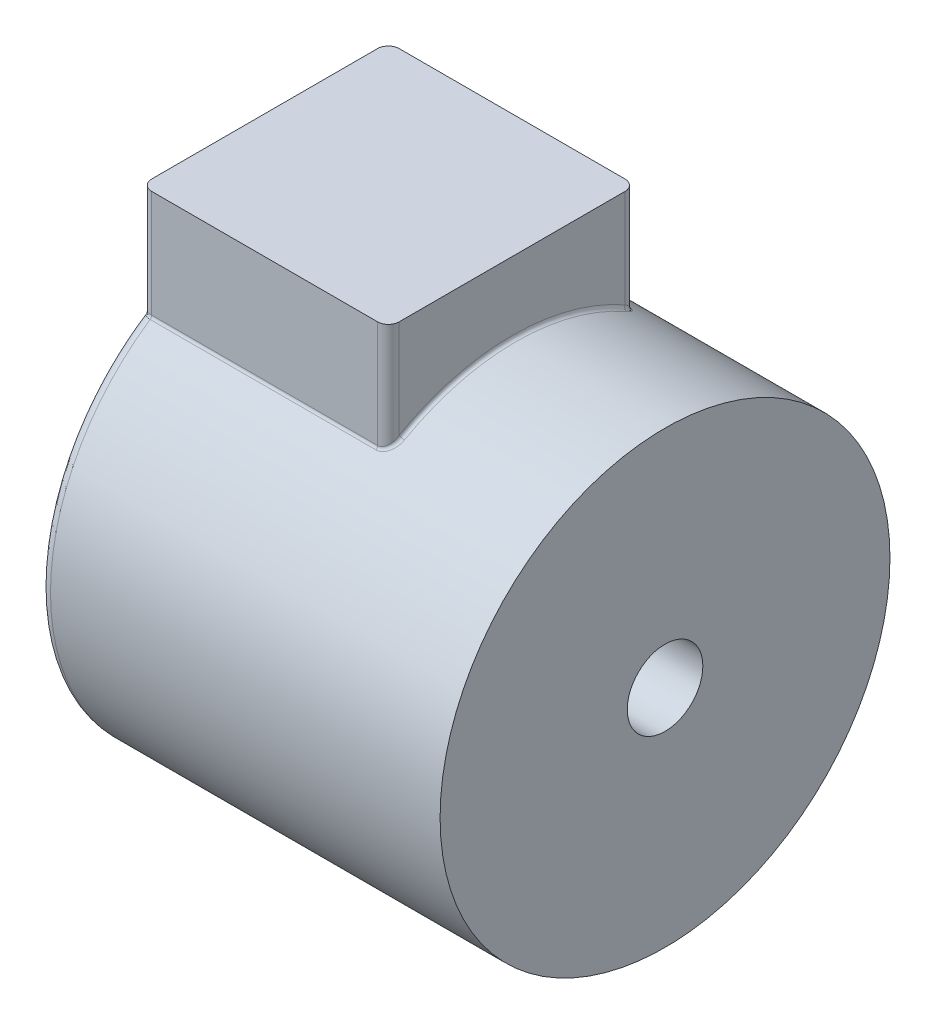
ISO-10303-21;
HEADER;
FILE_DESCRIPTION(('STEP AP214'),'2;1');
FILE_NAME('part.step','',(''),(''),'','','');
FILE_SCHEMA(('AUTOMOTIVE_DESIGN { 1 0 10303 214 1 1 1 1 }'));
ENDSEC;
DATA;
#1=APPLICATION_CONTEXT('core data for automotive mechanical design processes');
#2=APPLICATION_PROTOCOL_DEFINITION('international standard','automotive_design',2000,#1);
#3=PRODUCT_CONTEXT('',#1,'mechanical');
#4=PRODUCT('Part','Part','',(#3));
#5=PRODUCT_RELATED_PRODUCT_CATEGORY('part','',(#4));
#6=PRODUCT_DEFINITION_FORMATION('','',#4);
#7=PRODUCT_DEFINITION_CONTEXT('part definition',#1,'design');
#8=PRODUCT_DEFINITION('design','',#6,#7);
#9=PRODUCT_DEFINITION_SHAPE('','',#8);
#10=(LENGTH_UNIT() NAMED_UNIT(*) SI_UNIT(.MILLI.,.METRE.));
#11=(NAMED_UNIT(*) PLANE_ANGLE_UNIT() SI_UNIT($,.RADIAN.));
#12=(NAMED_UNIT(*) SI_UNIT($,.STERADIAN.) SOLID_ANGLE_UNIT());
#13=UNCERTAINTY_MEASURE_WITH_UNIT(LENGTH_MEASURE(1.E-05),#10,'distance_accuracy_value','');
#14=(GEOMETRIC_REPRESENTATION_CONTEXT(3) GLOBAL_UNCERTAINTY_ASSIGNED_CONTEXT((#13)) GLOBAL_UNIT_ASSIGNED_CONTEXT((#10,
#11,#12)) REPRESENTATION_CONTEXT('',''));
#15=CARTESIAN_POINT('',(0.,0.,0.));
#16=DIRECTION('',(0.,0.,1.));
#17=DIRECTION('',(1.,0.,0.));
#18=AXIS2_PLACEMENT_3D('',#15,#16,#17);
#19=CARTESIAN_POINT('',(0.,0.,0.));
#20=DIRECTION('',(1.,0.,0.));
#21=DIRECTION('',(0.,0.,-1.));
#22=AXIS2_PLACEMENT_3D('',#19,#20,#21);
#23=PLANE('',#22);
#24=CARTESIAN_POINT('',(0.,0.,0.));
#25=DIRECTION('',(1.,0.,0.));
#26=DIRECTION('',(0.,0.,-1.));
#27=AXIS2_PLACEMENT_3D('',#24,#25,#26);
#28=CIRCLE('',#27,30.226);
#29=CARTESIAN_POINT('',(0.,25.6821979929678,-15.9385));
#30=VERTEX_POINT('',#29);
#31=CARTESIAN_POINT('',(0.,25.6821979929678,15.9385));
#32=VERTEX_POINT('',#31);
#33=EDGE_CURVE('E150',#30,#32,#28,.F.);
#34=ORIENTED_EDGE('',*,*,#33,.T.);
#35=DIRECTION('',(0.,1.,0.));
#36=VECTOR('',#35,1.);
#37=CARTESIAN_POINT('',(0.,41.91,15.9385));
#38=LINE('',#37,#36);
#39=CARTESIAN_POINT('',(0.,41.91,15.9385));
#40=VERTEX_POINT('',#39);
#41=EDGE_CURVE('E144',#32,#40,#38,.T.);
#42=ORIENTED_EDGE('',*,*,#41,.T.);
#43=DIRECTION('',(0.,0.,1.));
#44=VECTOR('',#43,1.);
#45=CARTESIAN_POINT('',(0.,41.91,-17.4625));
#46=LINE('',#45,#44);
#47=CARTESIAN_POINT('',(0.,41.91,-15.9385));
#48=VERTEX_POINT('',#47);
#49=EDGE_CURVE('E357',#48,#40,#46,.T.);
#50=ORIENTED_EDGE('',*,*,#49,.F.);
#51=DIRECTION('',(0.,1.,0.));
#52=VECTOR('',#51,1.);
#53=CARTESIAN_POINT('',(0.,26.5164777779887,-15.9385));
#54=LINE('',#53,#52);
#55=EDGE_CURVE('E147',#48,#30,#54,.F.);
#56=ORIENTED_EDGE('',*,*,#55,.T.);
#57=EDGE_LOOP('',(#34,#42,#50,#56));
#58=FACE_BOUND('',#57,.T.);
#59=ADVANCED_FACE('F17',(#58),#23,.F.);
#60=CARTESIAN_POINT('',(0.,0.,0.));
#61=DIRECTION('',(-1.,0.,0.));
#62=DIRECTION('',(0.,0.,1.));
#63=AXIS2_PLACEMENT_3D('',#60,#61,#62);
#64=CYLINDRICAL_SURFACE('',#63,31.75);
#65=CARTESIAN_POINT('',(1.524,0.,0.));
#66=DIRECTION('',(1.,0.,0.));
#67=DIRECTION('',(0.,0.,-1.));
#68=AXIS2_PLACEMENT_3D('',#65,#66,#67);
#69=CIRCLE('',#68,31.75);
#70=CARTESIAN_POINT('',(1.524,26.3669270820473,17.6875));
#71=VERTEX_POINT('',#70);
#72=CARTESIAN_POINT('',(1.524,26.3669270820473,-17.6875));
#73=VERTEX_POINT('',#72);
#74=EDGE_CURVE('E153',#71,#73,#69,.T.);
#75=ORIENTED_EDGE('',*,*,#74,.T.);
#76=DIRECTION('',(-1.,0.,0.));
#77=VECTOR('',#76,1.);
#78=CARTESIAN_POINT('',(0.,26.3669270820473,-17.6875));
#79=LINE('',#78,#77);
#80=CARTESIAN_POINT('',(33.401,26.3669270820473,-17.6875));
#81=VERTEX_POINT('',#80);
#82=EDGE_CURVE('E315',#73,#81,#79,.F.);
#83=ORIENTED_EDGE('',*,*,#82,.T.);
#84=CARTESIAN_POINT('',(32.8091769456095,26.4248857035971,-17.6007930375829));
#85=CARTESIAN_POINT('',(32.9058596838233,26.5714034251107,-17.3808191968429));
#86=CARTESIAN_POINT('',(32.9571327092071,26.8476838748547,-17.3964292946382));
#87=CARTESIAN_POINT('',(32.8565279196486,26.4154331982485,-17.614983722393));
#88=CARTESIAN_POINT('',(32.9451403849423,26.5626968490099,-17.3941459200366));
#89=CARTESIAN_POINT('',(32.9926459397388,26.8380801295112,-17.4072425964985));
#90=CARTESIAN_POINT('',(32.904594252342,26.4070655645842,-17.6275226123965));
#91=CARTESIAN_POINT('',(32.9851936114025,26.5549687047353,-17.4059542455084));
#92=CARTESIAN_POINT('',(33.0286956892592,26.8295786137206,-17.4167972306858));
#93=CARTESIAN_POINT('',(33.0018778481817,26.3926124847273,-17.6491552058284));
#94=CARTESIAN_POINT('',(33.0663910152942,26.5416204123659,-17.4263273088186));
#95=CARTESIAN_POINT('',(33.1016583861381,26.8148942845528,-17.4332812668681));
#96=CARTESIAN_POINT('',(33.0510953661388,26.3865275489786,-17.6582481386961));
#97=CARTESIAN_POINT('',(33.1075610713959,26.5359915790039,-17.4349053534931));
#98=CARTESIAN_POINT('',(33.1385715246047,26.8087119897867,-17.4402100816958));
#99=CARTESIAN_POINT('',(33.1997079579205,26.3719021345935,-17.6800908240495));
#100=CARTESIAN_POINT('',(33.2319083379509,26.5224816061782,-17.4554825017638));
#101=CARTESIAN_POINT('',(33.2500309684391,26.7938525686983,-17.456854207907));
#102=CARTESIAN_POINT('',(33.3003668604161,26.3669297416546,-17.6874961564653));
#103=CARTESIAN_POINT('',(33.3165267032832,26.5178645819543,-17.4624960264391));
#104=CARTESIAN_POINT('',(33.325525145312,26.7888006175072,-17.4624970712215));
#105=CARTESIAN_POINT('',(33.501754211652,26.3669244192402,-17.6875038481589));
#106=CARTESIAN_POINT('',(33.4855748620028,26.517859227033,-17.4625039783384));
#107=CARTESIAN_POINT('',(33.4765656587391,26.788795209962,-17.4625029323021));
#108=CARTESIAN_POINT('',(33.6024825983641,26.371903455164,-17.6800883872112));
#109=CARTESIAN_POINT('',(33.5702542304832,26.5224819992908,-17.4554815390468));
#110=CARTESIAN_POINT('',(33.5521119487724,26.7938539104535,-17.4568523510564));
#111=CARTESIAN_POINT('',(33.8007312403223,26.3914486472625,-17.6508990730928));
#112=CARTESIAN_POINT('',(33.7362483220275,26.5405514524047,-17.4279605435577));
#113=CARTESIAN_POINT('',(33.7007984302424,26.8137118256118,-17.4346100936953));
#114=CARTESIAN_POINT('',(33.8982523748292,26.4060121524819,-17.6291291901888));
#115=CARTESIAN_POINT('',(33.8177928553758,26.5540474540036,-17.4073867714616));
#116=CARTESIAN_POINT('',(33.7739392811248,26.8285083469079,-17.4180214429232));
#117=CARTESIAN_POINT('',(34.087037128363,26.4436880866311,-17.5725637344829));
#118=CARTESIAN_POINT('',(33.9746369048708,26.5887924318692,-17.3542010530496));
#119=CARTESIAN_POINT('',(33.9155278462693,26.8667870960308,-17.3749185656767));
#120=CARTESIAN_POINT('',(34.1783229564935,26.4667680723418,-17.5378175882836));
#121=CARTESIAN_POINT('',(34.050133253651,26.6101024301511,-17.3214953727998));
#122=CARTESIAN_POINT('',(33.9839922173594,26.890236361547,-17.3484420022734));
#123=CARTESIAN_POINT('',(34.3531451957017,26.5202045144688,-17.4569068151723));
#124=CARTESIAN_POINT('',(34.1934293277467,26.6591806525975,-17.2457651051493));
#125=CARTESIAN_POINT('',(34.1151088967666,26.9445277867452,-17.2867879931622));
#126=CARTESIAN_POINT('',(34.4366765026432,26.5505657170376,-17.4107347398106));
#127=CARTESIAN_POINT('',(34.2613265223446,26.6870636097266,-17.20256031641));
#128=CARTESIAN_POINT('',(34.1777573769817,26.9753747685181,-17.2516048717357));
#129=CARTESIAN_POINT('',(34.6000139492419,26.619442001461,-17.3052600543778));
#130=CARTESIAN_POINT('',(34.3925410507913,26.7499758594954,-17.1044468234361));
#131=CARTESIAN_POINT('',(34.3002604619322,27.045353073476,-17.1712331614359));
#132=CARTESIAN_POINT('',(34.679186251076,26.6583696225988,-17.2452806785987));
#133=CARTESIAN_POINT('',(34.4552270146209,26.7854727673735,-17.0487627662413));
#134=CARTESIAN_POINT('',(34.359639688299,27.0849035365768,-17.1255288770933));
#135=CARTESIAN_POINT('',(34.8264202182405,26.7414463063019,-17.1161753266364));
#136=CARTESIAN_POINT('',(34.569746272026,26.8607090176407,-16.9298118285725));
#137=CARTESIAN_POINT('',(34.4700651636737,27.1693094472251,-17.0271505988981));
#138=CARTESIAN_POINT('',(34.8944589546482,26.7856058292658,-17.04703099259));
#139=CARTESIAN_POINT('',(34.6215143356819,26.9005852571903,-16.8663146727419));
#140=CARTESIAN_POINT('',(34.5210942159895,27.2141755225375,-16.9744626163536));
#141=CARTESIAN_POINT('',(35.0287911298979,26.8851366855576,-16.8896981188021));
#142=CARTESIAN_POINT('',(34.7212453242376,26.9898853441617,-16.722896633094));
#143=CARTESIAN_POINT('',(34.6218433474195,27.3152988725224,-16.8545749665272));
#144=CARTESIAN_POINT('',(35.0930399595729,26.9411684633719,-16.8002357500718));
#145=CARTESIAN_POINT('',(34.7669517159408,27.0398429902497,-16.641903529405));
#146=CARTESIAN_POINT('',(34.670029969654,27.3722271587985,-16.7864046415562));
#147=CARTESIAN_POINT('',(35.2052730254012,27.0565202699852,-16.613827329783));
#148=CARTESIAN_POINT('',(34.8429358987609,27.1416237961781,-16.4751477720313));
#149=CARTESIAN_POINT('',(34.7542047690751,27.4894245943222,-16.6443614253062));
#150=CARTESIAN_POINT('',(35.2532434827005,27.1158430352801,-16.5168750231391));
#151=CARTESIAN_POINT('',(34.8729381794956,27.1935698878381,-16.389146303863));
#152=CARTESIAN_POINT('',(34.7901826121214,27.5496965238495,-16.5704837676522));
#153=CARTESIAN_POINT('',(35.3392590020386,27.2463587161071,-16.3008242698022));
#154=CARTESIAN_POINT('',(34.9214287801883,27.306689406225,-16.1998367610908));
#155=CARTESIAN_POINT('',(34.8546942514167,27.6823004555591,-16.4058530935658));
#156=CARTESIAN_POINT('',(35.3742790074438,27.3178703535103,-16.1807431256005));
#157=CARTESIAN_POINT('',(34.9365363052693,27.3677984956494,-16.0962322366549));
#158=CARTESIAN_POINT('',(34.8809592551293,27.7549562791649,-16.3143512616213));
#159=CARTESIAN_POINT('',(35.4211514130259,27.4611064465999,-15.9364438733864));
#160=CARTESIAN_POINT('',(34.9463318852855,27.4881124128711,-15.8897172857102));
#161=CARTESIAN_POINT('',(34.9161135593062,27.9004841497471,-16.1281952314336));
#162=CARTESIAN_POINT('',(35.4330047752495,27.5328308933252,-15.8122259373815));
#163=CARTESIAN_POINT('',(34.9404179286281,27.5473192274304,-15.7867269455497));
#164=CARTESIAN_POINT('',(34.9250035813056,27.9733561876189,-16.0335411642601));
#165=CARTESIAN_POINT('',(35.4329952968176,27.6735207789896,-15.5646564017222));
#166=CARTESIAN_POINT('',(34.9093432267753,27.6609757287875,-15.58673589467));
#167=CARTESIAN_POINT('',(34.9249964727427,28.116297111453,-15.8448931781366));
#168=CARTESIAN_POINT('',(35.4214876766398,27.7425115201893,-15.4413200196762));
#169=CARTESIAN_POINT('',(34.8838677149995,27.7154031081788,-15.489737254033));
#170=CARTESIAN_POINT('',(34.9163657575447,28.1863917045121,-15.7509108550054));
#171=CARTESIAN_POINT('',(35.3749910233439,27.8771315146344,-15.1969780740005));
#172=CARTESIAN_POINT('',(34.8155167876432,27.8190830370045,-15.3031776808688));
#173=CARTESIAN_POINT('',(34.8814932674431,28.3231656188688,-15.5647222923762));
#174=CARTESIAN_POINT('',(35.339976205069,27.9427569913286,-15.0759752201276));
#175=CARTESIAN_POINT('',(34.772080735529,27.8681201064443,-15.213941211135));
#176=CARTESIAN_POINT('',(34.8552321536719,28.3898411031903,-15.4725181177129));
#177=CARTESIAN_POINT('',(35.2929818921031,28.0057596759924,-14.9579385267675));
#178=CARTESIAN_POINT('',(34.7218319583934,27.9127730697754,-15.1320374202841));
#179=CARTESIAN_POINT('',(34.8199864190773,28.4538518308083,-15.3825741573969));
#180=(BOUNDED_SURFACE() B_SPLINE_SURFACE(3,2,((#84,#85,#86),(#87,#88,#89),(#90,#91,#92),(#93,
#94,#95),(#96,#97,#98),(#99,#100,#101),(#102,#103,#104),(#105,#106,#107),(#108,#109,#110),(#111,
#112,#113),(#114,#115,#116),(#117,#118,#119),(#120,#121,#122),(#123,#124,#125),(#126,#127,#128),
(#129,#130,#131),(#132,#133,#134),(#135,#136,#137),(#138,#139,#140),(#141,#142,#143),(#144,#145,
#146),(#147,#148,#149),(#150,#151,#152),(#153,#154,#155),(#156,#157,#158),(#159,#160,#161),
(#162,#163,#164),(#165,#166,#167),(#168,#169,#170),(#171,#172,#173),(#174,#175,#176),(#177,#178,
#179)),.UNSPECIFIED.,.F.,.F.,.F.) B_SPLINE_SURFACE_WITH_KNOTS((4,2,2,2,2,2,2,2,2,2,2,2,2,2,2,4),
(3,3),(0.,0.151175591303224,0.302384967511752,0.603845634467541,0.905668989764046,
1.20740889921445,1.50801101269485,1.80880960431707,2.12994815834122,2.45173997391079,
2.82534005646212,3.19925558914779,3.63604163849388,4.07280954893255,4.50298584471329,
4.93363477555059),(0.,1.),
.UNSPECIFIED.) GEOMETRIC_REPRESENTATION_ITEM() RATIONAL_B_SPLINE_SURFACE(((1.,0.874734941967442,
1.),(1.,0.875981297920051,1.),(1.,0.877082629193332,1.),(1.,0.878982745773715,1.),(1.,
0.87978146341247,1.),(1.,0.881700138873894,1.),(1.,0.88235067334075,1.),(1.,0.882351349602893,
1.),(1.,0.881699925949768,1.),(1.,0.879135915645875,1.),(1.,0.877223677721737,1.),(1.,
0.872255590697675,1.),(1.,0.869204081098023,1.),(1.,0.862099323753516,1.),(1.,0.858045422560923,
1.),(1.,0.848786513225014,1.),(1.,0.843522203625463,1.),(1.,0.832193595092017,1.),(1.,
0.826127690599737,1.),(1.,0.812329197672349,1.),(1.,0.804485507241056,1.),(1.,0.788148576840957,
1.),(1.,0.779654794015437,1.),(1.,0.760735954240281,1.),(1.,0.750226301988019,1.),(1.,
0.728858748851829,1.),(1.,0.71800086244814,1.),(1.,0.696377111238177,1.),(1.,0.685612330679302,
1.),(1.,0.664303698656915,1.),(1.,0.653760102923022,1.),(1.,0.64348500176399,1.))) REPRESENTATION_ITEM('') SURFACE());
#181=CARTESIAN_POINT('',(32.8091769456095,26.4248857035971,-17.6007930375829));
#182=CARTESIAN_POINT('',(32.8565279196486,26.4154331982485,-17.614983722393));
#183=CARTESIAN_POINT('',(32.904594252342,26.4070655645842,-17.6275226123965));
#184=CARTESIAN_POINT('',(33.0018778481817,26.3926124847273,-17.6491552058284));
#185=CARTESIAN_POINT('',(33.0510953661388,26.3865275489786,-17.6582481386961));
#186=CARTESIAN_POINT('',(33.1997079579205,26.3719021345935,-17.6800908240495));
#187=CARTESIAN_POINT('',(33.3003668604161,26.3669297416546,-17.6874961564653));
#188=CARTESIAN_POINT('',(33.501754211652,26.3669244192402,-17.6875038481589));
#189=CARTESIAN_POINT('',(33.6024825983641,26.371903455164,-17.6800883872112));
#190=CARTESIAN_POINT('',(33.8007312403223,26.3914486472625,-17.6508990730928));
#191=CARTESIAN_POINT('',(33.8982523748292,26.4060121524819,-17.6291291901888));
#192=CARTESIAN_POINT('',(34.0870371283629,26.4436880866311,-17.5725637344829));
#193=CARTESIAN_POINT('',(34.1783229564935,26.4667680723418,-17.5378175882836));
#194=CARTESIAN_POINT('',(34.3531451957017,26.5202045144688,-17.4569068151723));
#195=CARTESIAN_POINT('',(34.4366765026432,26.5505657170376,-17.4107347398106));
#196=CARTESIAN_POINT('',(34.6000139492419,26.619442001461,-17.3052600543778));
#197=CARTESIAN_POINT('',(34.679186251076,26.6583696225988,-17.2452806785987));
#198=CARTESIAN_POINT('',(34.8264202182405,26.7414463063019,-17.1161753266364));
#199=CARTESIAN_POINT('',(34.8944589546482,26.7856058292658,-17.04703099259));
#200=CARTESIAN_POINT('',(35.0287911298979,26.8851366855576,-16.8896981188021));
#201=CARTESIAN_POINT('',(35.0930399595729,26.9411684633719,-16.8002357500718));
#202=CARTESIAN_POINT('',(35.2052730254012,27.0565202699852,-16.613827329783));
#203=CARTESIAN_POINT('',(35.2532434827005,27.1158430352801,-16.5168750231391));
#204=CARTESIAN_POINT('',(35.3392590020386,27.2463587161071,-16.3008242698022));
#205=CARTESIAN_POINT('',(35.3742790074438,27.3178703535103,-16.1807431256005));
#206=CARTESIAN_POINT('',(35.4211514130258,27.4611064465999,-15.9364438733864));
#207=CARTESIAN_POINT('',(35.4330047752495,27.5328308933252,-15.8122259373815));
#208=CARTESIAN_POINT('',(35.4329952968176,27.6735207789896,-15.5646564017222));
#209=CARTESIAN_POINT('',(35.4214876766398,27.7425115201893,-15.4413200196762));
#210=CARTESIAN_POINT('',(35.3749910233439,27.8771315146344,-15.1969780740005));
#211=CARTESIAN_POINT('',(35.339976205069,27.9427569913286,-15.0759752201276));
#212=CARTESIAN_POINT('',(35.2929818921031,28.0057596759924,-14.9579385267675));
#213=B_SPLINE_CURVE_WITH_KNOTS('',3,(#181,#182,#183,#184,#185,#186,#187,#188,#189,#190,#191,
#192,#193,#194,#195,#196,#197,#198,#199,#200,#201,#202,#203,#204,#205,#206,#207,#208,#209,#210,
#211,#212),.UNSPECIFIED.,.F.,.F.,(4,2,2,2,2,2,2,2,2,2,2,2,2,2,2,4),(0.,0.151175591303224,
0.302384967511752,0.603845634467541,0.905668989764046,1.20740889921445,1.50801101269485,
1.80880960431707,2.12994815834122,2.45173997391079,2.82534005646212,3.19925558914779,
3.63604163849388,4.07280954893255,4.50298584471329,4.93363477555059),.UNSPECIFIED.);
#214=CARTESIAN_POINT('',(35.433,27.6037106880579,-15.6875));
#215=VERTEX_POINT('',#214);
#216=EDGE_CURVE('E309',#81,#215,#213,.T.);
#217=ORIENTED_EDGE('',*,*,#216,.T.);
#218=CARTESIAN_POINT('',(35.433,0.,0.));
#219=DIRECTION('',(1.,0.,0.));
#220=DIRECTION('',(0.,0.,-1.));
#221=AXIS2_PLACEMENT_3D('',#218,#219,#220);
#222=CIRCLE('',#221,31.75);
#223=CARTESIAN_POINT('',(35.433,27.6037106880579,15.6875));
#224=VERTEX_POINT('',#223);
#225=EDGE_CURVE('E306',#215,#224,#222,.T.);
#226=ORIENTED_EDGE('',*,*,#225,.T.);
#227=CARTESIAN_POINT('',(35.2929818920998,28.0057596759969,14.9579385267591));
#228=CARTESIAN_POINT('',(34.7218319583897,27.9127730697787,15.1320374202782));
#229=CARTESIAN_POINT('',(34.8199864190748,28.4538518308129,15.3825741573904));
#230=CARTESIAN_POINT('',(35.3399372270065,27.9427634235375,15.0759547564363));
#231=CARTESIAN_POINT('',(34.7720432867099,27.8681067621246,15.2139571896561));
#232=CARTESIAN_POINT('',(34.8552029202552,28.3898476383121,15.4725025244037));
#233=CARTESIAN_POINT('',(35.3749430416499,27.8771958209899,15.1968557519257));
#234=CARTESIAN_POINT('',(34.8154607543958,27.8191224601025,15.3031020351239));
#235=CARTESIAN_POINT('',(34.8814572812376,28.3232309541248,15.564629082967));
#236=CARTESIAN_POINT('',(35.4214785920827,27.7426122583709,15.4411426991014));
#237=CARTESIAN_POINT('',(34.8838396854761,27.71548952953,15.4895862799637));
#238=CARTESIAN_POINT('',(34.9163589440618,28.1864940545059,15.7507757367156));
#239=CARTESIAN_POINT('',(35.4330054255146,27.673595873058,15.5645289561));
#240=CARTESIAN_POINT('',(34.9093409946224,27.6610478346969,15.5866142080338));
#241=CARTESIAN_POINT('',(34.9250040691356,28.116373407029,15.844796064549));
#242=CARTESIAN_POINT('',(35.4329934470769,27.5193035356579,15.8360241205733));
#243=CARTESIAN_POINT('',(34.9432900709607,27.5367396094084,15.8053368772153));
#244=CARTESIAN_POINT('',(34.9249950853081,27.959612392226,16.0516753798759));
#245=CARTESIAN_POINT('',(35.416163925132,27.4336290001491,15.983942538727));
#246=CARTESIAN_POINT('',(34.9481770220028,27.465723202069,15.9286041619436));
#247=CARTESIAN_POINT('',(34.9123729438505,27.8725670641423,16.1643892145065));
#248=CARTESIAN_POINT('',(35.3664544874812,27.3059044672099,16.2005307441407));
#249=CARTESIAN_POINT('',(34.9321654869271,27.3568706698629,16.1145552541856));
#250=CARTESIAN_POINT('',(34.8750908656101,27.7427989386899,16.329429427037));
#251=CARTESIAN_POINT('',(35.3457888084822,27.2634373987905,16.2718835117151));
#252=CARTESIAN_POINT('',(34.9231857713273,27.3206279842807,16.1760037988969));
#253=CARTESIAN_POINT('',(34.8595916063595,27.6996523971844,16.383800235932));
#254=CARTESIAN_POINT('',(35.296351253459,27.179100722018,16.4123641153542));
#255=CARTESIAN_POINT('',(34.8975444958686,27.2480871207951,16.2980594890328));
#256=CARTESIAN_POINT('',(34.8225134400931,27.6139663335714,16.4908464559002));
#257=CARTESIAN_POINT('',(35.2675665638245,27.1372321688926,16.481488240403));
#258=CARTESIAN_POINT('',(34.8809855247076,27.2117692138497,16.3587131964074));
#259=CARTESIAN_POINT('',(34.8009249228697,27.5714278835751,16.5435190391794));
#260=CARTESIAN_POINT('',(35.1775998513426,27.0239406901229,16.666977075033));
#261=CARTESIAN_POINT('',(34.82523285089,27.1133856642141,16.5217837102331));
#262=CARTESIAN_POINT('',(34.7334498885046,27.4563237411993,16.6848615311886));
#263=CARTESIAN_POINT('',(35.1082311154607,26.9536532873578,16.7803140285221));
#264=CARTESIAN_POINT('',(34.7782349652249,27.051133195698,16.6236357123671));
#265=CARTESIAN_POINT('',(34.6814233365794,27.3849117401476,16.7712242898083));
#266=CARTESIAN_POINT('',(34.9458527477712,26.8197393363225,16.9935256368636));
#267=CARTESIAN_POINT('',(34.6607941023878,26.9317000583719,16.8167071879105));
#268=CARTESIAN_POINT('',(34.5596395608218,27.2488551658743,16.9336915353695));
#269=CARTESIAN_POINT('',(34.8528894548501,26.7561000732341,17.0934260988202));
#270=CARTESIAN_POINT('',(34.5907654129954,26.8742357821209,16.9084444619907));
#271=CARTESIAN_POINT('',(34.4899170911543,27.1841976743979,17.0098156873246));
#272=CARTESIAN_POINT('',(34.6709308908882,26.6539314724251,17.252159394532));
#273=CARTESIAN_POINT('',(34.4488148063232,26.7814770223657,17.0550655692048));
#274=CARTESIAN_POINT('',(34.3534481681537,27.0803943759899,17.1307704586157));
#275=CARTESIAN_POINT('',(34.5868523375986,26.6131179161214,17.3149943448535));
#276=CARTESIAN_POINT('',(34.3821390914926,26.7442328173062,17.1134471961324));
#277=CARTESIAN_POINT('',(34.2903892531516,27.0389278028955,17.1786506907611));
#278=CARTESIAN_POINT('',(34.4072243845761,26.5390991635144,17.4282326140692));
#279=CARTESIAN_POINT('',(34.23760782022,26.6766103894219,17.2188087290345));
#280=CARTESIAN_POINT('',(34.1556682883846,26.9637247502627,17.2649382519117));
#281=CARTESIAN_POINT('',(34.3116752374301,26.5058937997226,17.478636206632));
#282=CARTESIAN_POINT('',(34.1596989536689,26.6460677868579,17.2660528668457));
#283=CARTESIAN_POINT('',(34.0840064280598,26.9299881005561,17.3033457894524));
#284=CARTESIAN_POINT('',(34.1102979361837,26.4488511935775,17.5648365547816));
#285=CARTESIAN_POINT('',(33.9940991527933,26.5936287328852,17.3468184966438));
#286=CARTESIAN_POINT('',(33.9329734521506,26.8720328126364,17.3690304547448));
#287=CARTESIAN_POINT('',(34.0043948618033,26.4250896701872,17.6005153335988));
#288=CARTESIAN_POINT('',(33.9061585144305,26.5716427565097,17.3804782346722));
#289=CARTESIAN_POINT('',(33.8535461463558,26.8478911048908,17.3962176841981));
#290=CARTESIAN_POINT('',(33.7863086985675,26.3891848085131,17.6543057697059));
#291=CARTESIAN_POINT('',(33.724375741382,26.5384994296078,17.4311089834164));
#292=CARTESIAN_POINT('',(33.6899815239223,26.8114117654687,17.4372059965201));
#293=CARTESIAN_POINT('',(33.6741456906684,26.3770063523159,17.6724705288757));
#294=CARTESIAN_POINT('',(33.6302719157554,26.5271947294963,17.4483063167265));
#295=CARTESIAN_POINT('',(33.6058592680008,26.7990384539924,17.4510475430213));
#296=CARTESIAN_POINT('',(33.5078691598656,26.3683141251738,17.6854319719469));
#297=CARTESIAN_POINT('',(33.4907302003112,26.5191449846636,17.4605488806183));
#298=CARTESIAN_POINT('',(33.4811518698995,26.790207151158,17.460924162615));
#299=CARTESIAN_POINT('',(33.4544575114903,26.3669207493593,17.6875086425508));
#300=CARTESIAN_POINT('',(33.4458743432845,26.517854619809,17.4625103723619));
#301=CARTESIAN_POINT('',(33.4410931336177,26.7887914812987,17.4625065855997));
#302=CARTESIAN_POINT('',(33.300735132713,26.3669389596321,17.6874837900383));
#303=CARTESIAN_POINT('',(33.3168335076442,26.5178755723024,17.4624805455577));
#304=CARTESIAN_POINT('',(33.3258013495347,26.7888099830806,17.4624876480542));
#305=CARTESIAN_POINT('',(33.2003089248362,26.3718748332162,17.6801317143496));
#306=CARTESIAN_POINT('',(33.2324133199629,26.5224566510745,17.4555206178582));
#307=CARTESIAN_POINT('',(33.2504816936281,26.7938248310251,17.4568853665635));
#308=CARTESIAN_POINT('',(33.0517905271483,26.3864431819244,17.6583740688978));
#309=CARTESIAN_POINT('',(33.1081426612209,26.5359133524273,17.4350244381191));
#310=CARTESIAN_POINT('',(33.139092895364,26.8086262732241,17.4403060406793));
#311=CARTESIAN_POINT('',(33.0024172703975,26.392537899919,17.6492666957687));
#312=CARTESIAN_POINT('',(33.0668415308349,26.5415514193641,17.4264324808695));
#313=CARTESIAN_POINT('',(33.1020629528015,26.8148185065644,17.4333662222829));
#314=CARTESIAN_POINT('',(32.904852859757,26.407021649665,17.627588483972));
#315=CARTESIAN_POINT('',(32.9854087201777,26.5549283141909,17.4060160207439));
#316=CARTESIAN_POINT('',(33.028889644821,26.8295339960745,17.4168474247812));
#317=CARTESIAN_POINT('',(32.8566608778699,26.4154090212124,17.6150201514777));
#318=CARTESIAN_POINT('',(32.9452503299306,26.5626748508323,17.3941797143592));
#319=CARTESIAN_POINT('',(32.9927456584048,26.8380555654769,17.40727035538));
#320=CARTESIAN_POINT('',(32.8091769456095,26.4248857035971,17.6007930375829));
#321=CARTESIAN_POINT('',(32.9058596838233,26.5714034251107,17.3808191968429));
#322=CARTESIAN_POINT('',(32.9571327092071,26.8476838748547,17.3964292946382));
#323=(BOUNDED_SURFACE() B_SPLINE_SURFACE(3,2,((#227,#228,#229),(#230,#231,#232),(#233,#234,
#235),(#236,#237,#238),(#239,#240,#241),(#242,#243,#244),(#245,#246,#247),(#248,#249,#250),
(#251,#252,#253),(#254,#255,#256),(#257,#258,#259),(#260,#261,#262),(#263,#264,#265),(#266,#267,
#268),(#269,#270,#271),(#272,#273,#274),(#275,#276,#277),(#278,#279,#280),(#281,#282,#283),
(#284,#285,#286),(#287,#288,#289),(#290,#291,#292),(#293,#294,#295),(#296,#297,#298),(#299,#300,
#301),(#302,#303,#304),(#305,#306,#307),(#308,#309,#310),(#311,#312,#313),(#314,#315,#316),
(#317,#318,#319),(#320,#321,#322)),.UNSPECIFIED.,.F.,.F.,.F.) B_SPLINE_SURFACE_WITH_KNOTS((4,2,
2,2,2,2,2,2,2,2,2,2,2,2,2,4),(3,3),(0.,0.430386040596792,0.8608252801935,1.38070872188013,
1.64094052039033,1.9015853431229,2.35573696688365,2.80900346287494,3.14790824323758,
3.48680556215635,3.8283677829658,4.16889111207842,4.32915273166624,4.62973930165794,
4.78142491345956,4.93300097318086),(0.,1.),
.UNSPECIFIED.) GEOMETRIC_REPRESENTATION_ITEM() RATIONAL_B_SPLINE_SURFACE(((1.,0.643485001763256,
1.),(1.,0.653758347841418,1.),(1.,0.664293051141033,1.),(1.,0.68559684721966,1.),(1.,
0.696365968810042,1.),(1.,0.720079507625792,1.),(1.,0.733010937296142,1.),(1.,0.751959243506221,
1.),(1.,0.758203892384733,1.),(1.,0.770502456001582,1.),(1.,0.776556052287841,1.),(1.,
0.792805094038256,1.),(1.,0.802738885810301,1.),(1.,0.821433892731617,1.),(1.,0.830197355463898,
1.),(1.,0.844125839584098,1.),(1.,0.849640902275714,1.),(1.,0.85958158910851,1.),(1.,
0.86400723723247,1.),(1.,0.87157686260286,1.),(1.,0.874710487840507,1.),(1.,0.879435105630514,
1.),(1.,0.881030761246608,1.),(1.,0.8821693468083,1.),(1.,0.882351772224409,1.),(1.,
0.882349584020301,1.),(1.,0.881703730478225,1.),(1.,0.879792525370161,1.),(1.,0.878992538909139,
1.),(1.,0.877088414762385,1.),(1.,0.875984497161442,1.),(1.,0.874734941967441,1.))) REPRESENTATION_ITEM('') SURFACE());
#324=CARTESIAN_POINT('',(35.2929818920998,28.0057596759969,14.9579385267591));
#325=CARTESIAN_POINT('',(35.3399372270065,27.9427634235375,15.0759547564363));
#326=CARTESIAN_POINT('',(35.3749430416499,27.8771958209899,15.1968557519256));
#327=CARTESIAN_POINT('',(35.4214785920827,27.7426122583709,15.4411426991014));
#328=CARTESIAN_POINT('',(35.4330054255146,27.673595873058,15.5645289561));
#329=CARTESIAN_POINT('',(35.4329934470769,27.5193035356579,15.8360241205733));
#330=CARTESIAN_POINT('',(35.416163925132,27.4336290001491,15.983942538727));
#331=CARTESIAN_POINT('',(35.3664544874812,27.3059044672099,16.2005307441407));
#332=CARTESIAN_POINT('',(35.3457888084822,27.2634373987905,16.2718835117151));
#333=CARTESIAN_POINT('',(35.296351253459,27.179100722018,16.4123641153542));
#334=CARTESIAN_POINT('',(35.2675665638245,27.1372321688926,16.481488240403));
#335=CARTESIAN_POINT('',(35.1775998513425,27.0239406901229,16.666977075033));
#336=CARTESIAN_POINT('',(35.1082311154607,26.9536532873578,16.7803140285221));
#337=CARTESIAN_POINT('',(34.9458527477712,26.8197393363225,16.9935256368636));
#338=CARTESIAN_POINT('',(34.8528894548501,26.7561000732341,17.0934260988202));
#339=CARTESIAN_POINT('',(34.6709308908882,26.6539314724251,17.252159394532));
#340=CARTESIAN_POINT('',(34.5868523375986,26.6131179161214,17.3149943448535));
#341=CARTESIAN_POINT('',(34.4072243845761,26.5390991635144,17.4282326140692));
#342=CARTESIAN_POINT('',(34.3116752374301,26.5058937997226,17.478636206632));
#343=CARTESIAN_POINT('',(34.1102979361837,26.4488511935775,17.5648365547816));
#344=CARTESIAN_POINT('',(34.0043948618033,26.4250896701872,17.6005153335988));
#345=CARTESIAN_POINT('',(33.7863086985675,26.3891848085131,17.6543057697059));
#346=CARTESIAN_POINT('',(33.6741456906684,26.3770063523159,17.6724705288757));
#347=CARTESIAN_POINT('',(33.5078691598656,26.3683141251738,17.6854319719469));
#348=CARTESIAN_POINT('',(33.4544575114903,26.3669207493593,17.6875086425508));
#349=CARTESIAN_POINT('',(33.300735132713,26.3669389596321,17.6874837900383));
#350=CARTESIAN_POINT('',(33.2003089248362,26.3718748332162,17.6801317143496));
#351=CARTESIAN_POINT('',(33.0517905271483,26.3864431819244,17.6583740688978));
#352=CARTESIAN_POINT('',(33.0024172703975,26.392537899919,17.6492666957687));
#353=CARTESIAN_POINT('',(32.904852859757,26.407021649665,17.627588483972));
#354=CARTESIAN_POINT('',(32.8566608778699,26.4154090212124,17.6150201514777));
#355=CARTESIAN_POINT('',(32.8091769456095,26.4248857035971,17.6007930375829));
#356=B_SPLINE_CURVE_WITH_KNOTS('',3,(#324,#325,#326,#327,#328,#329,#330,#331,#332,#333,#334,
#335,#336,#337,#338,#339,#340,#341,#342,#343,#344,#345,#346,#347,#348,#349,#350,#351,#352,#353,
#354,#355),.UNSPECIFIED.,.F.,.F.,(4,2,2,2,2,2,2,2,2,2,2,2,2,2,2,4),(0.,0.430386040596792,
0.8608252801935,1.38070872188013,1.64094052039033,1.9015853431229,2.35573696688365,
2.80900346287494,3.14790824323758,3.48680556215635,3.8283677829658,4.16889111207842,
4.32915273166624,4.62973930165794,4.78142491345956,4.93300097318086),.UNSPECIFIED.);
#357=CARTESIAN_POINT('',(33.401,26.3669270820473,17.6875));
#358=VERTEX_POINT('',#357);
#359=EDGE_CURVE('E300',#224,#358,#356,.T.);
#360=ORIENTED_EDGE('',*,*,#359,.T.);
#361=DIRECTION('',(-1.,0.,0.));
#362=VECTOR('',#361,1.);
#363=CARTESIAN_POINT('',(0.,26.3669270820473,17.6875));
#364=LINE('',#363,#362);
#365=EDGE_CURVE('E307',#358,#71,#364,.T.);
#366=ORIENTED_EDGE('',*,*,#365,.T.);
#367=EDGE_LOOP('',(#75,#83,#217,#226,#360,#366));
#368=FACE_BOUND('',#367,.T.);
#369=CARTESIAN_POINT('',(56.515,0.,0.));
#370=DIRECTION('',(-1.,0.,0.));
#371=DIRECTION('',(0.,0.,1.));
#372=AXIS2_PLACEMENT_3D('',#369,#370,#371);
#373=CIRCLE('',#372,31.75);
#374=CARTESIAN_POINT('',(56.515,0.,31.75));
#375=VERTEX_POINT('',#374);
#376=EDGE_CURVE('E122',#375,#375,#373,.T.);
#377=ORIENTED_EDGE('',*,*,#376,.T.);
#378=EDGE_LOOP('',(#377));
#379=FACE_BOUND('',#378,.T.);
#380=ADVANCED_FACE('F225',(#368,#379),#64,.T.);
#381=CARTESIAN_POINT('',(56.515,0.,0.));
#382=DIRECTION('',(-1.,0.,0.));
#383=DIRECTION('',(0.,0.,1.));
#384=AXIS2_PLACEMENT_3D('',#381,#382,#383);
#385=PLANE('',#384);
#386=CARTESIAN_POINT('',(56.515,0.,0.));
#387=DIRECTION('',(1.,0.,0.));
#388=DIRECTION('',(0.,0.,-1.));
#389=AXIS2_PLACEMENT_3D('',#386,#387,#388);
#390=CIRCLE('',#389,5.334);
#391=CARTESIAN_POINT('',(56.515,0.,-5.334));
#392=VERTEX_POINT('',#391);
#393=EDGE_CURVE('E350',#392,#392,#390,.T.);
#394=ORIENTED_EDGE('',*,*,#393,.F.);
#395=EDGE_LOOP('',(#394));
#396=FACE_BOUND('',#395,.T.);
#397=ORIENTED_EDGE('',*,*,#376,.F.);
#398=EDGE_LOOP('',(#397));
#399=FACE_BOUND('',#398,.T.);
#400=ADVANCED_FACE('F392',(#396,#399),#385,.F.);
#401=CARTESIAN_POINT('',(0.,41.91,-17.4625));
#402=DIRECTION('',(0.,1.,0.));
#403=DIRECTION('',(0.,0.,1.));
#404=AXIS2_PLACEMENT_3D('',#401,#402,#403);
#405=PLANE('',#404);
#406=DIRECTION('',(0.,0.,-1.));
#407=VECTOR('',#406,1.);
#408=CARTESIAN_POINT('',(34.925,41.91,17.4625));
#409=LINE('',#408,#407);
#410=CARTESIAN_POINT('',(34.925,41.91,15.9385));
#411=VERTEX_POINT('',#410);
#412=CARTESIAN_POINT('',(34.925,41.91,-15.9385));
#413=VERTEX_POINT('',#412);
#414=EDGE_CURVE('E109',#411,#413,#409,.T.);
#415=ORIENTED_EDGE('',*,*,#414,.T.);
#416=CARTESIAN_POINT('',(33.401,41.909999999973,-15.9385));
#417=DIRECTION('',(0.,1.,0.));
#418=DIRECTION('',(0.,0.,1.));
#419=AXIS2_PLACEMENT_3D('',#416,#417,#418);
#420=CIRCLE('',#419,1.524);
#421=CARTESIAN_POINT('',(33.401,41.91,-17.4625));
#422=VERTEX_POINT('',#421);
#423=EDGE_CURVE('E112',#413,#422,#420,.T.);
#424=ORIENTED_EDGE('',*,*,#423,.T.);
#425=DIRECTION('',(-1.,0.,0.));
#426=VECTOR('',#425,1.);
#427=CARTESIAN_POINT('',(34.925,41.91,-17.4625));
#428=LINE('',#427,#426);
#429=CARTESIAN_POINT('',(1.524,41.91,-17.4625));
#430=VERTEX_POINT('',#429);
#431=EDGE_CURVE('E360',#422,#430,#428,.T.);
#432=ORIENTED_EDGE('',*,*,#431,.T.);
#433=CARTESIAN_POINT('',(1.524,41.909999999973,-15.9385));
#434=DIRECTION('',(0.,1.,0.));
#435=DIRECTION('',(0.,0.,1.));
#436=AXIS2_PLACEMENT_3D('',#433,#434,#435);
#437=CIRCLE('',#436,1.524);
#438=EDGE_CURVE('E113',#430,#48,#437,.T.);
#439=ORIENTED_EDGE('',*,*,#438,.T.);
#440=ORIENTED_EDGE('',*,*,#49,.T.);
#441=CARTESIAN_POINT('',(1.524,41.91,15.9385));
#442=DIRECTION('',(0.,1.,0.));
#443=DIRECTION('',(0.,0.,1.));
#444=AXIS2_PLACEMENT_3D('',#441,#442,#443);
#445=CIRCLE('',#444,1.524);
#446=CARTESIAN_POINT('',(1.524,41.91,17.4625));
#447=VERTEX_POINT('',#446);
#448=EDGE_CURVE('E126',#40,#447,#445,.T.);
#449=ORIENTED_EDGE('',*,*,#448,.T.);
#450=DIRECTION('',(1.,0.,0.));
#451=VECTOR('',#450,1.);
#452=CARTESIAN_POINT('',(0.,41.91,17.4625));
#453=LINE('',#452,#451);
#454=CARTESIAN_POINT('',(33.401,41.91,17.4625));
#455=VERTEX_POINT('',#454);
#456=EDGE_CURVE('E111',#447,#455,#453,.T.);
#457=ORIENTED_EDGE('',*,*,#456,.T.);
#458=CARTESIAN_POINT('',(33.401,41.909999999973,15.9385));
#459=DIRECTION('',(0.,1.,0.));
#460=DIRECTION('',(0.,0.,1.));
#461=AXIS2_PLACEMENT_3D('',#458,#459,#460);
#462=CIRCLE('',#461,1.524);
#463=EDGE_CURVE('E106',#455,#411,#462,.T.);
#464=ORIENTED_EDGE('',*,*,#463,.T.);
#465=EDGE_LOOP('',(#415,#424,#432,#439,#440,#449,#457,#464));
#466=FACE_BOUND('',#465,.T.);
#467=ADVANCED_FACE('F108',(#466),#405,.T.);
#468=CARTESIAN_POINT('',(34.925,-500000.,-17.4625));
#469=DIRECTION('',(0.,0.,-1.));
#470=DIRECTION('',(-1.,0.,0.));
#471=AXIS2_PLACEMENT_3D('',#468,#469,#470);
#472=PLANE('',#471);
#473=DIRECTION('',(0.,1.,0.));
#474=VECTOR('',#473,1.);
#475=CARTESIAN_POINT('',(33.401,-500000.,-17.4625));
#476=LINE('',#475,#474);
#477=CARTESIAN_POINT('',(33.401,26.7887979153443,-17.4625));
#478=VERTEX_POINT('',#477);
#479=EDGE_CURVE('E137',#422,#478,#476,.F.);
#480=ORIENTED_EDGE('',*,*,#479,.T.);
#481=DIRECTION('',(-1.,0.,0.));
#482=VECTOR('',#481,1.);
#483=CARTESIAN_POINT('',(34.925,26.7887979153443,-17.4625));
#484=LINE('',#483,#482);
#485=CARTESIAN_POINT('',(1.524,26.7887979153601,-17.4625));
#486=VERTEX_POINT('',#485);
#487=EDGE_CURVE('E288',#478,#486,#484,.T.);
#488=ORIENTED_EDGE('',*,*,#487,.T.);
#489=DIRECTION('',(0.,1.,0.));
#490=VECTOR('',#489,1.);
#491=CARTESIAN_POINT('',(1.524,41.909999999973,-17.4625));
#492=LINE('',#491,#490);
#493=EDGE_CURVE('E135',#486,#430,#492,.T.);
#494=ORIENTED_EDGE('',*,*,#493,.T.);
#495=ORIENTED_EDGE('',*,*,#431,.F.);
#496=EDGE_LOOP('',(#480,#488,#494,#495));
#497=FACE_BOUND('',#496,.T.);
#498=ADVANCED_FACE('F383',(#497),#472,.T.);
#499=CARTESIAN_POINT('',(0.,-500000.,17.4625));
#500=DIRECTION('',(0.,0.,1.));
#501=DIRECTION('',(1.,0.,0.));
#502=AXIS2_PLACEMENT_3D('',#499,#500,#501);
#503=PLANE('',#502);
#504=DIRECTION('',(0.,1.,0.));
#505=VECTOR('',#504,1.);
#506=CARTESIAN_POINT('',(1.524,26.5164777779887,17.4625));
#507=LINE('',#506,#505);
#508=CARTESIAN_POINT('',(1.524,26.7887979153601,17.4625));
#509=VERTEX_POINT('',#508);
#510=EDGE_CURVE('E140',#447,#509,#507,.F.);
#511=ORIENTED_EDGE('',*,*,#510,.T.);
#512=DIRECTION('',(-1.,0.,0.));
#513=VECTOR('',#512,1.);
#514=CARTESIAN_POINT('',(0.,26.7887979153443,17.4625));
#515=LINE('',#514,#513);
#516=CARTESIAN_POINT('',(33.401,26.7887979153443,17.4625));
#517=VERTEX_POINT('',#516);
#518=EDGE_CURVE('E11',#509,#517,#515,.F.);
#519=ORIENTED_EDGE('',*,*,#518,.T.);
#520=DIRECTION('',(0.,1.,0.));
#521=VECTOR('',#520,1.);
#522=CARTESIAN_POINT('',(33.401,-500000.,17.4625));
#523=LINE('',#522,#521);
#524=EDGE_CURVE('E142',#517,#455,#523,.T.);
#525=ORIENTED_EDGE('',*,*,#524,.T.);
#526=ORIENTED_EDGE('',*,*,#456,.F.);
#527=EDGE_LOOP('',(#511,#519,#525,#526));
#528=FACE_BOUND('',#527,.T.);
#529=ADVANCED_FACE('F380',(#528),#503,.T.);
#530=CARTESIAN_POINT('',(34.925,-500000.,17.4625));
#531=DIRECTION('',(1.,0.,0.));
#532=DIRECTION('',(0.,0.,-1.));
#533=AXIS2_PLACEMENT_3D('',#530,#531,#532);
#534=PLANE('',#533);
#535=DIRECTION('',(0.,1.,0.));
#536=VECTOR('',#535,1.);
#537=CARTESIAN_POINT('',(34.925,-500000.,15.9385));
#538=LINE('',#537,#536);
#539=CARTESIAN_POINT('',(34.925,28.0453700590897,15.9385));
#540=VERTEX_POINT('',#539);
#541=EDGE_CURVE('E117',#411,#540,#538,.F.);
#542=ORIENTED_EDGE('',*,*,#541,.T.);
#543=CARTESIAN_POINT('',(34.925,0.,0.));
#544=DIRECTION('',(1.,0.,0.));
#545=DIRECTION('',(0.,0.,-1.));
#546=AXIS2_PLACEMENT_3D('',#543,#544,#545);
#547=CIRCLE('',#546,32.258);
#548=CARTESIAN_POINT('',(34.925,28.0453700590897,-15.9385));
#549=VERTEX_POINT('',#548);
#550=EDGE_CURVE('E323',#540,#549,#547,.F.);
#551=ORIENTED_EDGE('',*,*,#550,.T.);
#552=DIRECTION('',(0.,1.,0.));
#553=VECTOR('',#552,1.);
#554=CARTESIAN_POINT('',(34.925,-500000.,-15.9385));
#555=LINE('',#554,#553);
#556=EDGE_CURVE('E120',#549,#413,#555,.T.);
#557=ORIENTED_EDGE('',*,*,#556,.T.);
#558=ORIENTED_EDGE('',*,*,#414,.F.);
#559=EDGE_LOOP('',(#542,#551,#557,#558));
#560=FACE_BOUND('',#559,.T.);
#561=ADVANCED_FACE('F116',(#560),#534,.T.);
#562=CARTESIAN_POINT('',(33.401,-500000.,-15.9385));
#563=DIRECTION('',(0.,1.,0.));
#564=DIRECTION('',(0.,0.,1.));
#565=AXIS2_PLACEMENT_3D('',#562,#563,#564);
#566=CYLINDRICAL_SURFACE('',#565,1.524);
#567=ORIENTED_EDGE('',*,*,#556,.F.);
#568=CARTESIAN_POINT('',(34.8199864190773,28.4538518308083,-15.3825741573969));
#569=CARTESIAN_POINT('',(34.8552321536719,28.3898411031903,-15.4725181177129));
#570=CARTESIAN_POINT('',(34.8814932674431,28.3231656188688,-15.5647222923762));
#571=CARTESIAN_POINT('',(34.9163657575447,28.1863917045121,-15.7509108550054));
#572=CARTESIAN_POINT('',(34.9249964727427,28.116297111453,-15.8448931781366));
#573=CARTESIAN_POINT('',(34.9250035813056,27.9733561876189,-16.03354116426));
#574=CARTESIAN_POINT('',(34.9161135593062,27.9004841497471,-16.1281952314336));
#575=CARTESIAN_POINT('',(34.8809592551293,27.7549562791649,-16.3143512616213));
#576=CARTESIAN_POINT('',(34.8546942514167,27.6823004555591,-16.4058530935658));
#577=CARTESIAN_POINT('',(34.7901826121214,27.5496965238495,-16.5704837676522));
#578=CARTESIAN_POINT('',(34.7542047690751,27.4894245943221,-16.6443614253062));
#579=CARTESIAN_POINT('',(34.670029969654,27.3722271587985,-16.7864046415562));
#580=CARTESIAN_POINT('',(34.6218433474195,27.3152988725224,-16.8545749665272));
#581=CARTESIAN_POINT('',(34.5210942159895,27.2141755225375,-16.9744626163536));
#582=CARTESIAN_POINT('',(34.4700651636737,27.1693094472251,-17.0271505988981));
#583=CARTESIAN_POINT('',(34.359639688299,27.0849035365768,-17.1255288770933));
#584=CARTESIAN_POINT('',(34.3002604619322,27.045353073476,-17.1712331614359));
#585=CARTESIAN_POINT('',(34.1777573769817,26.9753747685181,-17.2516048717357));
#586=CARTESIAN_POINT('',(34.1151088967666,26.9445277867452,-17.2867879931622));
#587=CARTESIAN_POINT('',(33.9839922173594,26.890236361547,-17.3484420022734));
#588=CARTESIAN_POINT('',(33.9155278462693,26.8667870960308,-17.3749185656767));
#589=CARTESIAN_POINT('',(33.7739392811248,26.8285083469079,-17.4180214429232));
#590=CARTESIAN_POINT('',(33.7007984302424,26.8137118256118,-17.4346100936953));
#591=CARTESIAN_POINT('',(33.5521119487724,26.7938539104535,-17.4568523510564));
#592=CARTESIAN_POINT('',(33.4765656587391,26.788795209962,-17.4625029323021));
#593=CARTESIAN_POINT('',(33.3255251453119,26.7888006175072,-17.4624970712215));
#594=CARTESIAN_POINT('',(33.2500309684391,26.7938525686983,-17.456854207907));
#595=CARTESIAN_POINT('',(33.1385715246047,26.8087119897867,-17.4402100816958));
#596=CARTESIAN_POINT('',(33.1016583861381,26.8148942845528,-17.4332812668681));
#597=CARTESIAN_POINT('',(33.0286956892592,26.8295786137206,-17.4167972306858));
#598=CARTESIAN_POINT('',(32.9926459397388,26.8380801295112,-17.4072425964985));
#599=CARTESIAN_POINT('',(32.9571327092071,26.8476838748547,-17.3964292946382));
#600=B_SPLINE_CURVE_WITH_KNOTS('',3,(#568,#569,#570,#571,#572,#573,#574,#575,#576,#577,#578,
#579,#580,#581,#582,#583,#584,#585,#586,#587,#588,#589,#590,#591,#592,#593,#594,#595,#596,#597,
#598,#599),.UNSPECIFIED.,.F.,.F.,(4,2,2,2,2,2,2,2,2,2,2,2,2,2,2,4),(0.,0.430648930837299,
0.860825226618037,1.2975931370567,1.7343791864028,2.10829471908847,2.4818948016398,
2.80368661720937,3.12482517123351,3.42562376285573,3.72622587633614,4.02796578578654,
4.32978914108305,4.63124980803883,4.78245918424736,4.93363477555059),.UNSPECIFIED.);
#601=EDGE_CURVE('E317',#549,#478,#600,.T.);
#602=ORIENTED_EDGE('',*,*,#601,.T.);
#603=ORIENTED_EDGE('',*,*,#479,.F.);
#604=ORIENTED_EDGE('',*,*,#423,.F.);
#605=EDGE_LOOP('',(#567,#602,#603,#604));
#606=FACE_BOUND('',#605,.T.);
#607=ADVANCED_FACE('F256',(#606),#566,.T.);
#608=CARTESIAN_POINT('',(33.401,-500000.,15.9385));
#609=DIRECTION('',(0.,1.,0.));
#610=DIRECTION('',(0.,0.,1.));
#611=AXIS2_PLACEMENT_3D('',#608,#609,#610);
#612=CYLINDRICAL_SURFACE('',#611,1.524);
#613=ORIENTED_EDGE('',*,*,#524,.F.);
#614=CARTESIAN_POINT('',(32.9571327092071,26.8476838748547,17.3964292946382));
#615=CARTESIAN_POINT('',(32.9927456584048,26.8380555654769,17.40727035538));
#616=CARTESIAN_POINT('',(33.028889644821,26.8295339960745,17.4168474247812));
#617=CARTESIAN_POINT('',(33.1020629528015,26.8148185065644,17.4333662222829));
#618=CARTESIAN_POINT('',(33.139092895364,26.8086262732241,17.4403060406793));
#619=CARTESIAN_POINT('',(33.2504816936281,26.7938248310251,17.4568853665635));
#620=CARTESIAN_POINT('',(33.3258013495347,26.7888099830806,17.4624876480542));
#621=CARTESIAN_POINT('',(33.4410931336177,26.7887914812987,17.4625065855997));
#622=CARTESIAN_POINT('',(33.4811518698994,26.790207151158,17.460924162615));
#623=CARTESIAN_POINT('',(33.6058592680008,26.7990384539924,17.4510475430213));
#624=CARTESIAN_POINT('',(33.6899815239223,26.8114117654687,17.4372059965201));
#625=CARTESIAN_POINT('',(33.8535461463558,26.8478911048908,17.3962176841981));
#626=CARTESIAN_POINT('',(33.9329734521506,26.8720328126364,17.3690304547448));
#627=CARTESIAN_POINT('',(34.0840064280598,26.9299881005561,17.3033457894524));
#628=CARTESIAN_POINT('',(34.1556682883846,26.9637247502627,17.2649382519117));
#629=CARTESIAN_POINT('',(34.2903892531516,27.0389278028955,17.1786506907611));
#630=CARTESIAN_POINT('',(34.3534481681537,27.0803943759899,17.1307704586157));
#631=CARTESIAN_POINT('',(34.4899170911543,27.1841976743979,17.0098156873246));
#632=CARTESIAN_POINT('',(34.5596395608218,27.2488551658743,16.9336915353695));
#633=CARTESIAN_POINT('',(34.6814233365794,27.3849117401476,16.7712242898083));
#634=CARTESIAN_POINT('',(34.7334498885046,27.4563237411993,16.6848615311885));
#635=CARTESIAN_POINT('',(34.8009249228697,27.5714278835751,16.5435190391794));
#636=CARTESIAN_POINT('',(34.8225134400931,27.6139663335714,16.4908464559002));
#637=CARTESIAN_POINT('',(34.8595916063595,27.6996523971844,16.383800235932));
#638=CARTESIAN_POINT('',(34.8750908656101,27.7427989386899,16.329429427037));
#639=CARTESIAN_POINT('',(34.9123729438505,27.8725670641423,16.1643892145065));
#640=CARTESIAN_POINT('',(34.9249950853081,27.959612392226,16.0516753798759));
#641=CARTESIAN_POINT('',(34.9250040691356,28.116373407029,15.844796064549));
#642=CARTESIAN_POINT('',(34.9163589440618,28.1864940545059,15.7507757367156));
#643=CARTESIAN_POINT('',(34.8814572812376,28.3232309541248,15.564629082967));
#644=CARTESIAN_POINT('',(34.8552029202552,28.3898476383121,15.4725025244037));
#645=CARTESIAN_POINT('',(34.8199864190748,28.4538518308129,15.3825741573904));
#646=B_SPLINE_CURVE_WITH_KNOTS('',3,(#614,#615,#616,#617,#618,#619,#620,#621,#622,#623,#624,
#625,#626,#627,#628,#629,#630,#631,#632,#633,#634,#635,#636,#637,#638,#639,#640,#641,#642,#643,
#644,#645),.UNSPECIFIED.,.F.,.F.,(4,2,2,2,2,2,2,2,2,2,2,2,2,2,2,4),(0.,0.1515760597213,
0.303261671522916,0.603848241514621,0.764109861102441,1.10463319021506,1.44619541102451,
1.78509272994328,2.12399751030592,2.57726400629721,3.03141563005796,3.29206045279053,
3.55229225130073,4.07217569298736,4.50261493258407,4.93300097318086),.UNSPECIFIED.);
#647=EDGE_CURVE('E30',#517,#540,#646,.T.);
#648=ORIENTED_EDGE('',*,*,#647,.T.);
#649=ORIENTED_EDGE('',*,*,#541,.F.);
#650=ORIENTED_EDGE('',*,*,#463,.F.);
#651=EDGE_LOOP('',(#613,#648,#649,#650));
#652=FACE_BOUND('',#651,.T.);
#653=ADVANCED_FACE('F124',(#652),#612,.T.);
#654=CARTESIAN_POINT('',(1.524,-500000.,-15.9385));
#655=DIRECTION('',(0.,-1.,0.));
#656=DIRECTION('',(0.,0.,-1.));
#657=AXIS2_PLACEMENT_3D('',#654,#655,#656);
#658=CYLINDRICAL_SURFACE('',#657,1.524);
#659=ORIENTED_EDGE('',*,*,#493,.F.);
#660=CARTESIAN_POINT('',(0.,25.6821979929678,-15.9385));
#661=CARTESIAN_POINT('',(0.,25.6821979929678,-15.9385));
#662=CARTESIAN_POINT('',(0.,25.6821979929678,-15.9385));
#663=CARTESIAN_POINT('',(-1.06236999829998E-08,25.6831777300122,-15.9409733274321));
#664=CARTESIAN_POINT('',(-4.81775090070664E-08,25.6834803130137,-15.9408050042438));
#665=CARTESIAN_POINT('',(-1.06237184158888E-08,25.6837828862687,-15.9406366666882));
#666=CARTESIAN_POINT('',(4.48325209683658E-06,25.6841574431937,-15.9434467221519));
#667=CARTESIAN_POINT('',(5.1553377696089E-06,25.6847625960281,-15.9431101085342));
#668=CARTESIAN_POINT('',(4.48325207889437E-06,25.6853677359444,-15.9427734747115));
#669=CARTESIAN_POINT('',(0.000413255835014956,25.7286593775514,-16.0558025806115));
#670=CARTESIAN_POINT('',(0.000479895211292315,25.7430112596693,-16.0478287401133));
#671=CARTESIAN_POINT('',(0.000413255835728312,25.7573568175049,-16.0398433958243));
#672=CARTESIAN_POINT('',(0.00970395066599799,25.7721191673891,-16.1657785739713));
#673=CARTESIAN_POINT('',(0.0113163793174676,25.8000291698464,-16.1506631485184));
#674=CARTESIAN_POINT('',(0.00970395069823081,25.8276501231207,-16.1350211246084));
#675=CARTESIAN_POINT('',(0.0461763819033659,25.8576025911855,-16.3825704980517));
#676=CARTESIAN_POINT('',(0.0532070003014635,25.9112075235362,-16.3517784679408));
#677=CARTESIAN_POINT('',(0.0461763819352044,25.9658914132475,-16.3229469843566));
#678=CARTESIAN_POINT('',(0.0733808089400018,25.8996243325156,-16.4893822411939));
#679=CARTESIAN_POINT('',(0.0845078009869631,25.9656373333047,-16.4505508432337));
#680=CARTESIAN_POINT('',(0.0733808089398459,26.0338363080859,-16.4156918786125));
#681=CARTESIAN_POINT('',(0.145833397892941,25.9811817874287,-16.6971096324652));
#682=CARTESIAN_POINT('',(0.166275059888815,26.0698028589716,-16.6400749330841));
#683=CARTESIAN_POINT('',(0.145833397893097,26.1656833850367,-16.5963301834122));
#684=CARTESIAN_POINT('',(0.191167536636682,26.0207046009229,-16.7979945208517));
#685=CARTESIAN_POINT('',(0.217213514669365,26.119690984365,-16.7311119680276));
#686=CARTESIAN_POINT('',(0.191167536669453,26.2295645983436,-16.6841981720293));
#687=CARTESIAN_POINT('',(0.299356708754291,26.0954966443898,-16.9892562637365));
#688=CARTESIAN_POINT('',(0.33585034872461,26.2122882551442,-16.9004450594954));
#689=CARTESIAN_POINT('',(0.299356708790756,26.350430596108,-16.8510002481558));
#690=CARTESIAN_POINT('',(0.362146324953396,26.1307810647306,-17.0796706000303));
#691=CARTESIAN_POINT('',(0.403912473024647,26.2550640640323,-16.9788671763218));
#692=CARTESIAN_POINT('',(0.362146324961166,26.4074400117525,-16.9299661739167));
#693=CARTESIAN_POINT('',(0.488853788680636,26.1886647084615,-17.2282202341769));
#694=CARTESIAN_POINT('',(0.537222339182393,26.323529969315,-17.1045737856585));
#695=CARTESIAN_POINT('',(0.488853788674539,26.5009482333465,-17.0598455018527));
#696=CARTESIAN_POINT('',(0.549608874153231,26.2123586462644,-17.2891119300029));
#697=CARTESIAN_POINT('',(0.600256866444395,26.350948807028,-17.1549897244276));
#698=CARTESIAN_POINT('',(0.549608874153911,26.5392190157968,-17.1131362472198));
#699=CARTESIAN_POINT('',(0.676441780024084,26.2541957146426,-17.3967367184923));
#700=CARTESIAN_POINT('',(0.728882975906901,26.3984228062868,-17.2423492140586));
#701=CARTESIAN_POINT('',(0.676441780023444,26.6067874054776,-17.2073915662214));
#702=CARTESIAN_POINT('',(0.741995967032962,26.2725834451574,-17.4440921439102));
#703=CARTESIAN_POINT('',(0.794177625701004,26.4187483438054,-17.2797867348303));
#704=CARTESIAN_POINT('',(0.741995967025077,26.6364805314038,-17.2488969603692));
#705=CARTESIAN_POINT('',(0.880012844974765,26.3049119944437,-17.5274096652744));
#706=CARTESIAN_POINT('',(0.928891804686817,26.4538839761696,-17.3445278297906));
#707=CARTESIAN_POINT('',(0.880012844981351,26.6886814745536,-17.3219577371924));
#708=CARTESIAN_POINT('',(0.952480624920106,26.3188495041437,-17.5633632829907));
#709=CARTESIAN_POINT('',(0.998221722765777,26.4685915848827,-17.3716429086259));
#710=CARTESIAN_POINT('',(0.95248062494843,26.7111839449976,-17.3535057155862));
#711=CARTESIAN_POINT('',(1.10271741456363,26.3417021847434,-17.6223414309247));
#712=CARTESIAN_POINT('',(1.13962036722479,26.4924244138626,-17.4155868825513));
#713=CARTESIAN_POINT('',(1.10271741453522,26.7480782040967,-17.405272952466));
#714=CARTESIAN_POINT('',(1.18050061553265,26.3506032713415,-17.6453297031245));
#715=CARTESIAN_POINT('',(1.2114813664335,26.5014448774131,-17.4322227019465));
#716=CARTESIAN_POINT('',(1.1805006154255,26.7624472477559,-17.4254604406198));
#717=CARTESIAN_POINT('',(1.33889294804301,26.3628977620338,-17.6770873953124));
#718=CARTESIAN_POINT('',(1.35652931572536,26.5138738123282,-17.4551447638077));
#719=CARTESIAN_POINT('',(1.33889294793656,26.7822938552,-17.4533522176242));
#720=CARTESIAN_POINT('',(1.41950164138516,26.3662920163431,-17.6858590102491));
#721=CARTESIAN_POINT('',(1.42941117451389,26.5172286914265,-17.4613321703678));
#722=CARTESIAN_POINT('',(1.41950164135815,26.787772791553,-17.4610584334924));
#723=CARTESIAN_POINT('',(1.57703225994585,26.3673718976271,-17.6886493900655));
#724=CARTESIAN_POINT('',(1.57203211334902,26.5183055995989,-17.4633182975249));
#725=CARTESIAN_POINT('',(1.57703225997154,26.7895159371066,-17.4635097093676));
#726=CARTESIAN_POINT('',(1.653940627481,26.3653299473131,-17.6833721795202));
#727=CARTESIAN_POINT('',(1.64144872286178,26.5162916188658,-17.4596038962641));
#728=CARTESIAN_POINT('',(1.65394062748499,26.7862198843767,-17.4588732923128));
#729=CARTESIAN_POINT('',(1.76778175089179,26.358496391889,-17.6657182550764));
#730=CARTESIAN_POINT('',(1.74531841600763,26.5094107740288,-17.4469137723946));
#731=CARTESIAN_POINT('',(1.7677817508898,26.7751888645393,-17.4433670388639));
#732=CARTESIAN_POINT('',(1.80551944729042,26.3555843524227,-17.6581957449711));
#733=CARTESIAN_POINT('',(1.77984093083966,26.5064776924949,-17.4415044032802));
#734=CARTESIAN_POINT('',(1.80551944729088,26.7704880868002,-17.4367599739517));
#735=CARTESIAN_POINT('',(1.88023122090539,26.3485356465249,-17.6399912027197));
#736=CARTESIAN_POINT('',(1.84860147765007,26.4993117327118,-17.4282890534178));
#737=CARTESIAN_POINT('',(1.8802312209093,26.7591093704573,-17.4207732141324));
#738=CARTESIAN_POINT('',(1.91720532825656,26.3443990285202,-17.6293092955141));
#739=CARTESIAN_POINT('',(1.88280888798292,26.4950858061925,-17.4204958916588));
#740=CARTESIAN_POINT('',(1.91720532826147,26.7524315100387,-17.4113936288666));
#741=CARTESIAN_POINT('',(1.95368737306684,26.3396682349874,-17.6170960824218));
#742=CARTESIAN_POINT('',(1.91689572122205,26.4901983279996,-17.4114831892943));
#743=CARTESIAN_POINT('',(1.95368737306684,26.7447942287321,-17.4006712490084));
#744=(BOUNDED_SURFACE() B_SPLINE_SURFACE(3,2,((#660,#661,#662),(#663,#664,#665),(#666,#667,
#668),(#669,#670,#671),(#672,#673,#674),(#675,#676,#677),(#678,#679,#680),(#681,#682,#683),
(#684,#685,#686),(#687,#688,#689),(#690,#691,#692),(#693,#694,#695),(#696,#697,#698),(#699,#700,
#701),(#702,#703,#704),(#705,#706,#707),(#708,#709,#710),(#711,#712,#713),(#714,#715,#716),
(#717,#718,#719),(#720,#721,#722),(#723,#724,#725),(#726,#727,#728),(#729,#730,#731),(#732,#733,
#734),(#735,#736,#737),(#738,#739,#740),(#741,#742,#743)),.UNSPECIFIED.,.F.,.F.,
.F.) B_SPLINE_SURFACE_WITH_KNOTS((4,2,2,2,2,2,2,2,2,2,2,2,2,4),(3,3),(0.,0.00978062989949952,
0.44428412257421,0.879339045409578,1.31648207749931,1.75200843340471,2.09362228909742,
2.41513282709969,2.7368818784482,3.0595263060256,3.3821209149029,3.68885740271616,
3.84259388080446,3.99632428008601),(0.,1.),
.UNSPECIFIED.) GEOMETRIC_REPRESENTATION_ITEM() RATIONAL_B_SPLINE_SURFACE(((1.,1.,1.),(1.,
1.00000000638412,1.),(1.,0.999999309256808,1.),(1.,0.99993573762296,1.),(1.,0.998487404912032,
1.),(1.,0.99301660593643,1.),(1.,0.98899087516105,1.),(1.,0.978776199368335,1.),(1.,
0.97257696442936,1.),(1.,0.958762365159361,1.),(1.,0.951152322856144,1.),(1.,0.937232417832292,
1.),(1.,0.930996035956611,1.),(1.,0.91926951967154,1.),(1.,0.913757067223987,1.),(1.,
0.903647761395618,1.),(1.,0.899051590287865,1.),(1.,0.891318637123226,1.),(1.,0.888185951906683,
1.),(1.,0.883817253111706,1.),(1.,0.882580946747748,1.),(1.,0.882189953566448,1.),(1.,
0.882935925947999,1.),(1.,0.885381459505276,1.),(1.,0.886419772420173,1.),(1.,0.888903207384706,
1.),(1.,0.890348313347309,1.),(1.,0.891978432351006,1.))) REPRESENTATION_ITEM('') SURFACE());
#745=CARTESIAN_POINT('',(1.95368737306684,26.7447942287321,-17.4006712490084));
#746=CARTESIAN_POINT('',(1.91720532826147,26.7524315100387,-17.4113936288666));
#747=CARTESIAN_POINT('',(1.8802312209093,26.7591093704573,-17.4207732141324));
#748=CARTESIAN_POINT('',(1.80551944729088,26.7704880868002,-17.4367599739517));
#749=CARTESIAN_POINT('',(1.7677817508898,26.7751888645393,-17.4433670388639));
#750=CARTESIAN_POINT('',(1.65394062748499,26.7862198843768,-17.4588732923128));
#751=CARTESIAN_POINT('',(1.57703225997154,26.7895159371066,-17.4635097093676));
#752=CARTESIAN_POINT('',(1.41950164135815,26.787772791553,-17.4610584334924));
#753=CARTESIAN_POINT('',(1.33889294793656,26.7822938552,-17.4533522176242));
#754=CARTESIAN_POINT('',(1.1805006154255,26.7624472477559,-17.4254604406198));
#755=CARTESIAN_POINT('',(1.10271741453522,26.7480782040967,-17.405272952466));
#756=CARTESIAN_POINT('',(0.95248062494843,26.7111839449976,-17.3535057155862));
#757=CARTESIAN_POINT('',(0.880012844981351,26.6886814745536,-17.3219577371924));
#758=CARTESIAN_POINT('',(0.741995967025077,26.6364805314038,-17.2488969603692));
#759=CARTESIAN_POINT('',(0.676441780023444,26.6067874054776,-17.2073915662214));
#760=CARTESIAN_POINT('',(0.549608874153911,26.5392190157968,-17.1131362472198));
#761=CARTESIAN_POINT('',(0.488853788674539,26.5009482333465,-17.0598455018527));
#762=CARTESIAN_POINT('',(0.362146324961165,26.4074400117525,-16.9299661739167));
#763=CARTESIAN_POINT('',(0.299356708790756,26.350430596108,-16.8510002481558));
#764=CARTESIAN_POINT('',(0.191167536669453,26.2295645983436,-16.6841981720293));
#765=CARTESIAN_POINT('',(0.145833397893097,26.1656833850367,-16.5963301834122));
#766=CARTESIAN_POINT('',(0.0733808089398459,26.0338363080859,-16.4156918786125));
#767=CARTESIAN_POINT('',(0.0461763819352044,25.9658914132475,-16.3229469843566));
#768=CARTESIAN_POINT('',(0.00970395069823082,25.8276501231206,-16.1350211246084));
#769=CARTESIAN_POINT('',(0.000413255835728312,25.7573568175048,-16.0398433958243));
#770=CARTESIAN_POINT('',(4.48325207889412E-06,25.6853677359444,-15.9427734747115));
#771=CARTESIAN_POINT('',(-1.06237184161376E-08,25.6837828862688,-15.9406366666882));
#772=CARTESIAN_POINT('',(0.,25.6821979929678,-15.9385));
#773=B_SPLINE_CURVE_WITH_KNOTS('',3,(#745,#746,#747,#748,#749,#750,#751,#752,#753,#754,#755,
#756,#757,#758,#759,#760,#761,#762,#763,#764,#765,#766,#767,#768,#769,#770,#771,#772),
.UNSPECIFIED.,.F.,.F.,(4,2,2,2,2,2,2,2,2,2,2,2,2,4),(0.,0.153730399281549,0.307466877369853,
0.614203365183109,0.936797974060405,1.25944240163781,1.58119145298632,1.90270199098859,
2.24431584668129,2.6798422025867,3.11698523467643,3.5520401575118,3.98654365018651,
3.99632428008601),.UNSPECIFIED.);
#774=EDGE_CURVE('E281',#486,#30,#773,.T.);
#775=ORIENTED_EDGE('',*,*,#774,.T.);
#776=ORIENTED_EDGE('',*,*,#55,.F.);
#777=ORIENTED_EDGE('',*,*,#438,.F.);
#778=EDGE_LOOP('',(#659,#775,#776,#777));
#779=FACE_BOUND('',#778,.T.);
#780=ADVANCED_FACE('F275',(#779),#658,.T.);
#781=CARTESIAN_POINT('',(1.524,0.,15.9385));
#782=DIRECTION('',(0.,-1.,0.));
#783=DIRECTION('',(0.,0.,-1.));
#784=AXIS2_PLACEMENT_3D('',#781,#782,#783);
#785=CYLINDRICAL_SURFACE('',#784,1.524);
#786=ORIENTED_EDGE('',*,*,#41,.F.);
#787=CARTESIAN_POINT('',(0.,25.6821979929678,15.9385));
#788=CARTESIAN_POINT('',(0.,25.6821979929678,15.9385));
#789=CARTESIAN_POINT('',(0.,25.6821979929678,15.9385));
#790=CARTESIAN_POINT('',(-1.06237164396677E-08,25.6837828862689,15.9406366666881));
#791=CARTESIAN_POINT('',(-4.81775079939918E-08,25.6834803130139,15.9408050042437));
#792=CARTESIAN_POINT('',(-1.06236997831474E-08,25.6831777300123,15.940973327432));
#793=CARTESIAN_POINT('',(4.48325208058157E-06,25.6853677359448,15.9427734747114));
#794=CARTESIAN_POINT('',(5.15533777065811E-06,25.6847625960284,15.943110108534));
#795=CARTESIAN_POINT('',(4.48325209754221E-06,25.684157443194,15.9434467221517));
#796=CARTESIAN_POINT('',(0.00041325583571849,25.7573568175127,16.0398433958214));
#797=CARTESIAN_POINT('',(0.000479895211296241,25.7430112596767,16.0478287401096));
#798=CARTESIAN_POINT('',(0.00041325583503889,25.7286593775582,16.0558025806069));
#799=CARTESIAN_POINT('',(0.00970395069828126,25.8276501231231,16.1350211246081));
#800=CARTESIAN_POINT('',(0.0113163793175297,25.8000291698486,16.1506631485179));
#801=CARTESIAN_POINT('',(0.00970395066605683,25.7721191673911,16.1657785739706));
#802=CARTESIAN_POINT('',(0.0461763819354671,25.9658914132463,16.3229469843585));
#803=CARTESIAN_POINT('',(0.0532070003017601,25.9112075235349,16.3517784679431));
#804=CARTESIAN_POINT('',(0.0461763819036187,25.8576025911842,16.3825704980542));
#805=CARTESIAN_POINT('',(0.0733808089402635,26.0338363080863,16.4156918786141));
#806=CARTESIAN_POINT('',(0.0845078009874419,25.965637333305,16.4505508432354));
#807=CARTESIAN_POINT('',(0.0733808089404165,25.8996243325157,16.4893822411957));
#808=CARTESIAN_POINT('',(0.145833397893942,26.1656833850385,16.5963301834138));
#809=CARTESIAN_POINT('',(0.16627505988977,26.0698028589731,16.6400749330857));
#810=CARTESIAN_POINT('',(0.14583339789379,25.98118178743,16.6971096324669));
#811=CARTESIAN_POINT('',(0.191167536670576,26.2295645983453,16.6841981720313));
#812=CARTESIAN_POINT('',(0.217213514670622,26.1196909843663,16.7311119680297));
#813=CARTESIAN_POINT('',(0.191167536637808,26.0207046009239,16.797994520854));
#814=CARTESIAN_POINT('',(0.299356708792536,26.3504305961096,16.8510002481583));
#815=CARTESIAN_POINT('',(0.335850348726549,26.2122882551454,16.9004450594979));
#816=CARTESIAN_POINT('',(0.299356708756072,26.0954966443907,16.9892562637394));
#817=CARTESIAN_POINT('',(0.362146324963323,26.4074400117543,16.9299661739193));
#818=CARTESIAN_POINT('',(0.403912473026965,26.2550640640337,16.9788671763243));
#819=CARTESIAN_POINT('',(0.362146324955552,26.1307810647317,17.0796706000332));
#820=CARTESIAN_POINT('',(0.488853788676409,26.5009482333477,17.0598455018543));
#821=CARTESIAN_POINT('',(0.53722233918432,26.3235299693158,17.10457378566));
#822=CARTESIAN_POINT('',(0.488853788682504,26.1886647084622,17.2282202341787));
#823=CARTESIAN_POINT('',(0.549608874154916,26.5392190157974,17.1131362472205));
#824=CARTESIAN_POINT('',(0.600256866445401,26.3509488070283,17.1549897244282));
#825=CARTESIAN_POINT('',(0.549608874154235,26.2123586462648,17.2891119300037));
#826=CARTESIAN_POINT('',(0.676441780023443,26.6067874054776,17.2073915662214));
#827=CARTESIAN_POINT('',(0.728882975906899,26.3984228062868,17.2423492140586));
#828=CARTESIAN_POINT('',(0.676441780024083,26.2541957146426,17.3967367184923));
#829=CARTESIAN_POINT('',(0.741995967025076,26.6364805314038,17.2488969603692));
#830=CARTESIAN_POINT('',(0.794177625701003,26.4187483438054,17.2797867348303));
#831=CARTESIAN_POINT('',(0.741995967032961,26.2725834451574,17.4440921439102));
#832=CARTESIAN_POINT('',(0.88001284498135,26.6886814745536,17.3219577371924));
#833=CARTESIAN_POINT('',(0.928891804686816,26.4538839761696,17.3445278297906));
#834=CARTESIAN_POINT('',(0.880012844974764,26.3049119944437,17.5274096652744));
#835=CARTESIAN_POINT('',(0.952480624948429,26.7111839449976,17.3535057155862));
#836=CARTESIAN_POINT('',(0.998221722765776,26.4685915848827,17.3716429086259));
#837=CARTESIAN_POINT('',(0.952480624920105,26.3188495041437,17.5633632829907));
#838=CARTESIAN_POINT('',(1.10271741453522,26.7480782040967,17.405272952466));
#839=CARTESIAN_POINT('',(1.13962036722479,26.4924244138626,17.4155868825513));
#840=CARTESIAN_POINT('',(1.10271741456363,26.3417021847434,17.6223414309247));
#841=CARTESIAN_POINT('',(1.18050061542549,26.7624472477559,17.4254604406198));
#842=CARTESIAN_POINT('',(1.21148136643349,26.5014448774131,17.4322227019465));
#843=CARTESIAN_POINT('',(1.18050061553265,26.3506032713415,17.6453297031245));
#844=CARTESIAN_POINT('',(1.33889294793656,26.7822938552,17.4533522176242));
#845=CARTESIAN_POINT('',(1.35652931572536,26.5138738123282,17.4551447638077));
#846=CARTESIAN_POINT('',(1.33889294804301,26.3628977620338,17.6770873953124));
#847=CARTESIAN_POINT('',(1.41950164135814,26.787772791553,17.4610584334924));
#848=CARTESIAN_POINT('',(1.42941117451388,26.5172286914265,17.4613321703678));
#849=CARTESIAN_POINT('',(1.41950164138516,26.3662920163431,17.6858590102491));
#850=CARTESIAN_POINT('',(1.57703225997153,26.7895159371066,17.4635097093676));
#851=CARTESIAN_POINT('',(1.57203211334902,26.5183055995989,17.4633182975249));
#852=CARTESIAN_POINT('',(1.57703225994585,26.3673718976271,17.6886493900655));
#853=CARTESIAN_POINT('',(1.65394062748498,26.7862198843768,17.4588732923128));
#854=CARTESIAN_POINT('',(1.64144872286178,26.5162916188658,17.4596038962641));
#855=CARTESIAN_POINT('',(1.653940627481,26.3653299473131,17.6833721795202));
#856=CARTESIAN_POINT('',(1.76778175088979,26.7751888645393,17.4433670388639));
#857=CARTESIAN_POINT('',(1.74531841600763,26.5094107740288,17.4469137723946));
#858=CARTESIAN_POINT('',(1.76778175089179,26.358496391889,17.6657182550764));
#859=CARTESIAN_POINT('',(1.80551944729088,26.7704880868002,17.4367599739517));
#860=CARTESIAN_POINT('',(1.77984093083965,26.5064776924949,17.4415044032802));
#861=CARTESIAN_POINT('',(1.80551944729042,26.3555843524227,17.6581957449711));
#862=CARTESIAN_POINT('',(1.8802312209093,26.7591093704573,17.4207732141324));
#863=CARTESIAN_POINT('',(1.84860147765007,26.4993117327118,17.4282890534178));
#864=CARTESIAN_POINT('',(1.88023122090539,26.3485356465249,17.6399912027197));
#865=CARTESIAN_POINT('',(1.91720532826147,26.7524315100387,17.4113936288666));
#866=CARTESIAN_POINT('',(1.88280888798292,26.4950858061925,17.4204958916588));
#867=CARTESIAN_POINT('',(1.91720532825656,26.3443990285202,17.6293092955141));
#868=CARTESIAN_POINT('',(1.95368737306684,26.7447942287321,17.4006712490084));
#869=CARTESIAN_POINT('',(1.91689572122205,26.4901983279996,17.4114831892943));
#870=CARTESIAN_POINT('',(1.95368737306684,26.3396682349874,17.6170960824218));
#871=(BOUNDED_SURFACE() B_SPLINE_SURFACE(3,2,((#787,#788,#789),(#790,#791,#792),(#793,#794,
#795),(#796,#797,#798),(#799,#800,#801),(#802,#803,#804),(#805,#806,#807),(#808,#809,#810),
(#811,#812,#813),(#814,#815,#816),(#817,#818,#819),(#820,#821,#822),(#823,#824,#825),(#826,#827,
#828),(#829,#830,#831),(#832,#833,#834),(#835,#836,#837),(#838,#839,#840),(#841,#842,#843),
(#844,#845,#846),(#847,#848,#849),(#850,#851,#852),(#853,#854,#855),(#856,#857,#858),(#859,#860,
#861),(#862,#863,#864),(#865,#866,#867),(#868,#869,#870)),.UNSPECIFIED.,.F.,.F.,
.F.) B_SPLINE_SURFACE_WITH_KNOTS((4,2,2,2,2,2,2,2,2,2,2,2,2,4),(3,3),(0.,0.00978062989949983,
0.444284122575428,0.879339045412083,1.31648207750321,1.75200843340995,2.09362228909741,
2.41513282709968,2.73688187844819,3.05952630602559,3.38212091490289,3.68885740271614,
3.84259388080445,3.996324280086),(0.,1.),
.UNSPECIFIED.) GEOMETRIC_REPRESENTATION_ITEM() RATIONAL_B_SPLINE_SURFACE(((1.,1.,1.),(1.,
1.00000000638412,1.),(1.,0.999999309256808,1.),(1.,0.999935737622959,1.),(1.,0.998487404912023,
1.),(1.,0.993016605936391,1.),(1.,0.988990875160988,1.),(1.,0.978776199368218,1.),(1.,
0.972576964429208,1.),(1.,0.95876236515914,1.),(1.,0.95115232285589,1.),(1.,0.9372324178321,1.),
(1.,0.930996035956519,1.),(1.,0.91926951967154,1.),(1.,0.913757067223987,1.),(1.,
0.903647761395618,1.),(1.,0.899051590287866,1.),(1.,0.891318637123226,1.),(1.,0.888185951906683,
1.),(1.,0.883817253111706,1.),(1.,0.882580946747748,1.),(1.,0.882189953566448,1.),(1.,
0.882935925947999,1.),(1.,0.885381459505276,1.),(1.,0.886419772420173,1.),(1.,0.888903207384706,
1.),(1.,0.890348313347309,1.),(1.,0.891978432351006,1.))) REPRESENTATION_ITEM('') SURFACE());
#872=CARTESIAN_POINT('',(1.95368737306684,26.7447942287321,17.4006712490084));
#873=CARTESIAN_POINT('',(1.91720532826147,26.7524315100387,17.4113936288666));
#874=CARTESIAN_POINT('',(1.8802312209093,26.7591093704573,17.4207732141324));
#875=CARTESIAN_POINT('',(1.80551944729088,26.7704880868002,17.4367599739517));
#876=CARTESIAN_POINT('',(1.76778175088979,26.7751888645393,17.4433670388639));
#877=CARTESIAN_POINT('',(1.65394062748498,26.7862198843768,17.4588732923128));
#878=CARTESIAN_POINT('',(1.57703225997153,26.7895159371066,17.4635097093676));
#879=CARTESIAN_POINT('',(1.41950164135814,26.787772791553,17.4610584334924));
#880=CARTESIAN_POINT('',(1.33889294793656,26.7822938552,17.4533522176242));
#881=CARTESIAN_POINT('',(1.18050061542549,26.7624472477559,17.4254604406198));
#882=CARTESIAN_POINT('',(1.10271741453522,26.7480782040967,17.405272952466));
#883=CARTESIAN_POINT('',(0.952480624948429,26.7111839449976,17.3535057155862));
#884=CARTESIAN_POINT('',(0.88001284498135,26.6886814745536,17.3219577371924));
#885=CARTESIAN_POINT('',(0.741995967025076,26.6364805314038,17.2488969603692));
#886=CARTESIAN_POINT('',(0.676441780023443,26.6067874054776,17.2073915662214));
#887=CARTESIAN_POINT('',(0.549608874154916,26.5392190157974,17.1131362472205));
#888=CARTESIAN_POINT('',(0.488853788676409,26.5009482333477,17.0598455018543));
#889=CARTESIAN_POINT('',(0.362146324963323,26.4074400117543,16.9299661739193));
#890=CARTESIAN_POINT('',(0.299356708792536,26.3504305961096,16.8510002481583));
#891=CARTESIAN_POINT('',(0.191167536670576,26.2295645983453,16.6841981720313));
#892=CARTESIAN_POINT('',(0.145833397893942,26.1656833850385,16.5963301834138));
#893=CARTESIAN_POINT('',(0.0733808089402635,26.0338363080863,16.4156918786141));
#894=CARTESIAN_POINT('',(0.0461763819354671,25.9658914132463,16.3229469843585));
#895=CARTESIAN_POINT('',(0.00970395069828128,25.8276501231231,16.1350211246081));
#896=CARTESIAN_POINT('',(0.00041325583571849,25.7573568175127,16.0398433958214));
#897=CARTESIAN_POINT('',(4.48325208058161E-06,25.6853677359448,15.9427734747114));
#898=CARTESIAN_POINT('',(-1.06237164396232E-08,25.6837828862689,15.9406366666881));
#899=CARTESIAN_POINT('',(0.,25.6821979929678,15.9385));
#900=B_SPLINE_CURVE_WITH_KNOTS('',3,(#872,#873,#874,#875,#876,#877,#878,#879,#880,#881,#882,
#883,#884,#885,#886,#887,#888,#889,#890,#891,#892,#893,#894,#895,#896,#897,#898,#899),
.UNSPECIFIED.,.F.,.F.,(4,2,2,2,2,2,2,2,2,2,2,2,2,4),(0.,0.153730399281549,0.307466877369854,
0.614203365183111,0.936797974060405,1.25944240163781,1.58119145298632,1.90270199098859,
2.24431584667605,2.67984220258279,3.11698523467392,3.55204015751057,3.9865436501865,
3.996324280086),.UNSPECIFIED.);
#901=EDGE_CURVE('E156',#32,#509,#900,.F.);
#902=ORIENTED_EDGE('',*,*,#901,.T.);
#903=ORIENTED_EDGE('',*,*,#510,.F.);
#904=ORIENTED_EDGE('',*,*,#448,.F.);
#905=EDGE_LOOP('',(#786,#902,#903,#904));
#906=FACE_BOUND('',#905,.T.);
#907=ADVANCED_FACE('F173',(#906),#785,.T.);
#908=CARTESIAN_POINT('',(1.524,0.,0.));
#909=DIRECTION('',(1.,0.,0.));
#910=DIRECTION('',(0.,0.,-1.));
#911=AXIS2_PLACEMENT_3D('',#908,#909,#910);
#912=TOROIDAL_SURFACE('',#911,30.226,1.524);
#913=ORIENTED_EDGE('',*,*,#74,.F.);
#914=CARTESIAN_POINT('',(1.95368737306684,26.3396682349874,17.6170960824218));
#915=CARTESIAN_POINT('',(1.91720532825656,26.3443990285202,17.6293092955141));
#916=CARTESIAN_POINT('',(1.88023122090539,26.3485356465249,17.6399912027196));
#917=CARTESIAN_POINT('',(1.80551944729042,26.3555843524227,17.6581957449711));
#918=CARTESIAN_POINT('',(1.76778175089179,26.358496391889,17.6657182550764));
#919=CARTESIAN_POINT('',(1.653940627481,26.3653299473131,17.6833721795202));
#920=CARTESIAN_POINT('',(1.57703225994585,26.3673718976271,17.6886493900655));
#921=CARTESIAN_POINT('',(1.41950164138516,26.3662920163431,17.6858590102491));
#922=CARTESIAN_POINT('',(1.33889294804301,26.3628977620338,17.6770873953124));
#923=CARTESIAN_POINT('',(1.18050061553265,26.3506032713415,17.6453297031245));
#924=CARTESIAN_POINT('',(1.10271741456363,26.3417021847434,17.6223414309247));
#925=CARTESIAN_POINT('',(0.952480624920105,26.3188495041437,17.5633632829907));
#926=CARTESIAN_POINT('',(0.880012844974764,26.3049119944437,17.5274096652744));
#927=CARTESIAN_POINT('',(0.741995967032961,26.2725834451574,17.4440921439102));
#928=CARTESIAN_POINT('',(0.676441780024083,26.2541957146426,17.3967367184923));
#929=CARTESIAN_POINT('',(0.549608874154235,26.2123586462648,17.2891119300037));
#930=CARTESIAN_POINT('',(0.488853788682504,26.1886647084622,17.2282202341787));
#931=CARTESIAN_POINT('',(0.362146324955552,26.1307810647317,17.0796706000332));
#932=CARTESIAN_POINT('',(0.299356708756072,26.0954966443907,16.9892562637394));
#933=CARTESIAN_POINT('',(0.191167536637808,26.0207046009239,16.797994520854));
#934=CARTESIAN_POINT('',(0.14583339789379,25.98118178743,16.6971096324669));
#935=CARTESIAN_POINT('',(0.0733808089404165,25.8996243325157,16.4893822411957));
#936=CARTESIAN_POINT('',(0.0461763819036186,25.8576025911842,16.3825704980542));
#937=CARTESIAN_POINT('',(0.00970395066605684,25.7721191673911,16.1657785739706));
#938=CARTESIAN_POINT('',(0.00041325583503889,25.7286593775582,16.0558025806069));
#939=CARTESIAN_POINT('',(4.48325209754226E-06,25.684157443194,15.9434467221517));
#940=CARTESIAN_POINT('',(-1.0623699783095E-08,25.6831777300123,15.940973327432));
#941=CARTESIAN_POINT('',(0.,25.6821979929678,15.9385));
#942=B_SPLINE_CURVE_WITH_KNOTS('',3,(#914,#915,#916,#917,#918,#919,#920,#921,#922,#923,#924,
#925,#926,#927,#928,#929,#930,#931,#932,#933,#934,#935,#936,#937,#938,#939,#940,#941),
.UNSPECIFIED.,.F.,.F.,(4,2,2,2,2,2,2,2,2,2,2,2,2,4),(0.,0.153730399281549,0.307466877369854,
0.614203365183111,0.936797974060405,1.25944240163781,1.58119145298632,1.90270199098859,
2.24431584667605,2.67984220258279,3.11698523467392,3.55204015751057,3.9865436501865,
3.996324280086),.UNSPECIFIED.);
#943=EDGE_CURVE('E289',#71,#32,#942,.T.);
#944=ORIENTED_EDGE('',*,*,#943,.T.);
#945=ORIENTED_EDGE('',*,*,#33,.F.);
#946=CARTESIAN_POINT('',(1.95368737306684,26.3396682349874,-17.6170960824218));
#947=CARTESIAN_POINT('',(1.91720532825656,26.3443990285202,-17.6293092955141));
#948=CARTESIAN_POINT('',(1.88023122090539,26.3485356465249,-17.6399912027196));
#949=CARTESIAN_POINT('',(1.80551944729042,26.3555843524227,-17.6581957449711));
#950=CARTESIAN_POINT('',(1.76778175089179,26.358496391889,-17.6657182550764));
#951=CARTESIAN_POINT('',(1.653940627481,26.3653299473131,-17.6833721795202));
#952=CARTESIAN_POINT('',(1.57703225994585,26.3673718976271,-17.6886493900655));
#953=CARTESIAN_POINT('',(1.41950164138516,26.3662920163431,-17.6858590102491));
#954=CARTESIAN_POINT('',(1.33889294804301,26.3628977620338,-17.6770873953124));
#955=CARTESIAN_POINT('',(1.18050061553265,26.3506032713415,-17.6453297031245));
#956=CARTESIAN_POINT('',(1.10271741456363,26.3417021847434,-17.6223414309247));
#957=CARTESIAN_POINT('',(0.952480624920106,26.3188495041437,-17.5633632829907));
#958=CARTESIAN_POINT('',(0.880012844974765,26.3049119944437,-17.5274096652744));
#959=CARTESIAN_POINT('',(0.741995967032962,26.2725834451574,-17.4440921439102));
#960=CARTESIAN_POINT('',(0.676441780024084,26.2541957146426,-17.3967367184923));
#961=CARTESIAN_POINT('',(0.549608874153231,26.2123586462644,-17.2891119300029));
#962=CARTESIAN_POINT('',(0.488853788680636,26.1886647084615,-17.2282202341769));
#963=CARTESIAN_POINT('',(0.362146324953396,26.1307810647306,-17.0796706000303));
#964=CARTESIAN_POINT('',(0.299356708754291,26.0954966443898,-16.9892562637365));
#965=CARTESIAN_POINT('',(0.191167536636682,26.0207046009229,-16.7979945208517));
#966=CARTESIAN_POINT('',(0.145833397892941,25.9811817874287,-16.6971096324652));
#967=CARTESIAN_POINT('',(0.0733808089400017,25.8996243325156,-16.4893822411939));
#968=CARTESIAN_POINT('',(0.0461763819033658,25.8576025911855,-16.3825704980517));
#969=CARTESIAN_POINT('',(0.00970395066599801,25.772119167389,-16.1657785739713));
#970=CARTESIAN_POINT('',(0.000413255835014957,25.7286593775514,-16.0558025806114));
#971=CARTESIAN_POINT('',(4.48325209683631E-06,25.6841574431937,-15.9434467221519));
#972=CARTESIAN_POINT('',(-1.06236999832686E-08,25.6831777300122,-15.9409733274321));
#973=CARTESIAN_POINT('',(0.,25.6821979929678,-15.9385));
#974=B_SPLINE_CURVE_WITH_KNOTS('',3,(#946,#947,#948,#949,#950,#951,#952,#953,#954,#955,#956,
#957,#958,#959,#960,#961,#962,#963,#964,#965,#966,#967,#968,#969,#970,#971,#972,#973),
.UNSPECIFIED.,.F.,.F.,(4,2,2,2,2,2,2,2,2,2,2,2,2,4),(0.,0.153730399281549,0.307466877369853,
0.614203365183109,0.936797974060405,1.25944240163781,1.58119145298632,1.90270199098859,
2.24431584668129,2.6798422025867,3.11698523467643,3.5520401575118,3.98654365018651,
3.99632428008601),.UNSPECIFIED.);
#975=EDGE_CURVE('E165',#30,#73,#974,.F.);
#976=ORIENTED_EDGE('',*,*,#975,.T.);
#977=EDGE_LOOP('',(#913,#944,#945,#976));
#978=FACE_BOUND('',#977,.T.);
#979=ADVANCED_FACE('F178',(#978),#912,.T.);
#980=ORIENTED_EDGE('',*,*,#975,.F.);
#981=ORIENTED_EDGE('',*,*,#774,.F.);
#982=CARTESIAN_POINT('',(1.524,26.7887979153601,-17.9705));
#983=DIRECTION('',(-1.,0.,0.));
#984=DIRECTION('',(0.,0.,1.));
#985=AXIS2_PLACEMENT_3D('',#982,#983,#984);
#986=CIRCLE('',#985,0.508);
#987=EDGE_CURVE('E264',#73,#486,#986,.T.);
#988=ORIENTED_EDGE('',*,*,#987,.F.);
#989=EDGE_LOOP('',(#980,#981,#988));
#990=FACE_BOUND('',#989,.T.);
#991=ADVANCED_FACE('F268',(#990),#744,.F.);
#992=CARTESIAN_POINT('',(0.,26.7887979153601,-17.9705));
#993=DIRECTION('',(-1.,0.,0.));
#994=DIRECTION('',(0.,0.,1.));
#995=AXIS2_PLACEMENT_3D('',#992,#993,#994);
#996=CYLINDRICAL_SURFACE('',#995,0.508);
#997=ORIENTED_EDGE('',*,*,#987,.T.);
#998=ORIENTED_EDGE('',*,*,#487,.F.);
#999=CARTESIAN_POINT('',(33.401,26.7887979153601,-17.9705));
#1000=DIRECTION('',(-1.,0.,0.));
#1001=DIRECTION('',(0.,0.,1.));
#1002=AXIS2_PLACEMENT_3D('',#999,#1000,#1001);
#1003=CIRCLE('',#1002,0.508);
#1004=EDGE_CURVE('E263',#81,#478,#1003,.T.);
#1005=ORIENTED_EDGE('',*,*,#1004,.F.);
#1006=ORIENTED_EDGE('',*,*,#82,.F.);
#1007=EDGE_LOOP('',(#997,#998,#1005,#1006));
#1008=FACE_BOUND('',#1007,.T.);
#1009=ADVANCED_FACE('F250',(#1008),#996,.F.);
#1010=ORIENTED_EDGE('',*,*,#1004,.T.);
#1011=ORIENTED_EDGE('',*,*,#601,.F.);
#1012=CARTESIAN_POINT('',(35.433,28.0453700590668,-15.9385));
#1013=DIRECTION('',(0.,-0.494094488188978,-0.869408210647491));
#1014=DIRECTION('',(0.,0.869408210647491,-0.494094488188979));
#1015=AXIS2_PLACEMENT_3D('',#1012,#1013,#1014);
#1016=CIRCLE('',#1015,0.508);
#1017=EDGE_CURVE('E238',#215,#549,#1016,.T.);
#1018=ORIENTED_EDGE('',*,*,#1017,.F.);
#1019=ORIENTED_EDGE('',*,*,#216,.F.);
#1020=EDGE_LOOP('',(#1010,#1011,#1018,#1019));
#1021=FACE_BOUND('',#1020,.T.);
#1022=ADVANCED_FACE('F244',(#1021),#180,.F.);
#1023=CARTESIAN_POINT('',(35.433,0.,0.));
#1024=DIRECTION('',(1.,0.,0.));
#1025=DIRECTION('',(0.,0.,-1.));
#1026=AXIS2_PLACEMENT_3D('',#1023,#1024,#1025);
#1027=TOROIDAL_SURFACE('',#1026,32.258,0.508);
#1028=ORIENTED_EDGE('',*,*,#1017,.T.);
#1029=ORIENTED_EDGE('',*,*,#550,.F.);
#1030=CARTESIAN_POINT('',(35.433,28.0453700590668,15.9385));
#1031=DIRECTION('',(0.,0.494094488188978,-0.869408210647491));
#1032=DIRECTION('',(0.,0.869408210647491,0.494094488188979));
#1033=AXIS2_PLACEMENT_3D('',#1030,#1031,#1032);
#1034=CIRCLE('',#1033,0.508);
#1035=EDGE_CURVE('E237',#224,#540,#1034,.T.);
#1036=ORIENTED_EDGE('',*,*,#1035,.F.);
#1037=ORIENTED_EDGE('',*,*,#225,.F.);
#1038=EDGE_LOOP('',(#1028,#1029,#1036,#1037));
#1039=FACE_BOUND('',#1038,.T.);
#1040=ADVANCED_FACE('F219',(#1039),#1027,.F.);
#1041=ORIENTED_EDGE('',*,*,#1035,.T.);
#1042=ORIENTED_EDGE('',*,*,#647,.F.);
#1043=CARTESIAN_POINT('',(33.401,26.7887979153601,17.9705));
#1044=DIRECTION('',(1.,0.,0.));
#1045=DIRECTION('',(0.,0.,-1.));
#1046=AXIS2_PLACEMENT_3D('',#1043,#1044,#1045);
#1047=CIRCLE('',#1046,0.508);
#1048=EDGE_CURVE('E206',#358,#517,#1047,.T.);
#1049=ORIENTED_EDGE('',*,*,#1048,.F.);
#1050=ORIENTED_EDGE('',*,*,#359,.F.);
#1051=EDGE_LOOP('',(#1041,#1042,#1049,#1050));
#1052=FACE_BOUND('',#1051,.T.);
#1053=ADVANCED_FACE('F211',(#1052),#323,.F.);
#1054=CARTESIAN_POINT('',(0.,26.7887979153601,17.9705));
#1055=DIRECTION('',(-1.,0.,0.));
#1056=DIRECTION('',(0.,0.,1.));
#1057=AXIS2_PLACEMENT_3D('',#1054,#1055,#1056);
#1058=CYLINDRICAL_SURFACE('',#1057,0.508);
#1059=ORIENTED_EDGE('',*,*,#1048,.T.);
#1060=ORIENTED_EDGE('',*,*,#518,.F.);
#1061=CARTESIAN_POINT('',(1.524,26.7887979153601,17.9705));
#1062=DIRECTION('',(1.,0.,0.));
#1063=DIRECTION('',(0.,0.,-1.));
#1064=AXIS2_PLACEMENT_3D('',#1061,#1062,#1063);
#1065=CIRCLE('',#1064,0.508);
#1066=EDGE_CURVE('E205',#71,#509,#1065,.T.);
#1067=ORIENTED_EDGE('',*,*,#1066,.F.);
#1068=ORIENTED_EDGE('',*,*,#365,.F.);
#1069=EDGE_LOOP('',(#1059,#1060,#1067,#1068));
#1070=FACE_BOUND('',#1069,.T.);
#1071=ADVANCED_FACE('F190',(#1070),#1058,.F.);
#1072=ORIENTED_EDGE('',*,*,#901,.F.);
#1073=ORIENTED_EDGE('',*,*,#943,.F.);
#1074=ORIENTED_EDGE('',*,*,#1066,.T.);
#1075=EDGE_LOOP('',(#1072,#1073,#1074));
#1076=FACE_BOUND('',#1075,.T.);
#1077=ADVANCED_FACE('F183',(#1076),#871,.F.);
#1078=CARTESIAN_POINT('',(48.895,0.,0.));
#1079=DIRECTION('',(1.,0.,0.));
#1080=DIRECTION('',(0.,0.,-1.));
#1081=AXIS2_PLACEMENT_3D('',#1078,#1079,#1080);
#1082=CYLINDRICAL_SURFACE('',#1081,5.334);
#1083=CARTESIAN_POINT('',(48.895,0.,0.));
#1084=DIRECTION('',(1.,0.,0.));
#1085=DIRECTION('',(0.,0.,-1.));
#1086=AXIS2_PLACEMENT_3D('',#1083,#1084,#1085);
#1087=CIRCLE('',#1086,5.334);
#1088=CARTESIAN_POINT('',(48.895,0.,-5.334));
#1089=VERTEX_POINT('',#1088);
#1090=EDGE_CURVE('E345',#1089,#1089,#1087,.T.);
#1091=ORIENTED_EDGE('',*,*,#1090,.F.);
#1092=EDGE_LOOP('',(#1091));
#1093=FACE_BOUND('',#1092,.T.);
#1094=ORIENTED_EDGE('',*,*,#393,.T.);
#1095=EDGE_LOOP('',(#1094));
#1096=FACE_BOUND('',#1095,.T.);
#1097=ADVANCED_FACE('F189',(#1093,#1096),#1082,.F.);
#1098=CARTESIAN_POINT('',(48.895,0.,0.));
#1099=DIRECTION('',(1.,0.,0.));
#1100=DIRECTION('',(0.,0.,-1.));
#1101=AXIS2_PLACEMENT_3D('',#1098,#1099,#1100);
#1102=PLANE('',#1101);
#1103=ORIENTED_EDGE('',*,*,#1090,.T.);
#1104=EDGE_LOOP('',(#1103));
#1105=FACE_BOUND('',#1104,.T.);
#1106=ADVANCED_FACE('F416',(#1105),#1102,.T.);
#1107=CLOSED_SHELL('',(#59,#380,#400,#467,#498,#529,#561,#607,#653,#780,#907,#979,#991,#1009,
#1022,#1040,#1053,#1071,#1077,#1097,#1106));
#1108=MANIFOLD_SOLID_BREP('B1',#1107);
#1109=ADVANCED_BREP_SHAPE_REPRESENTATION('',(#18,#1108),#14);
#1110=SHAPE_DEFINITION_REPRESENTATION(#9,#1109);
ENDSEC;
END-ISO-10303-21;
